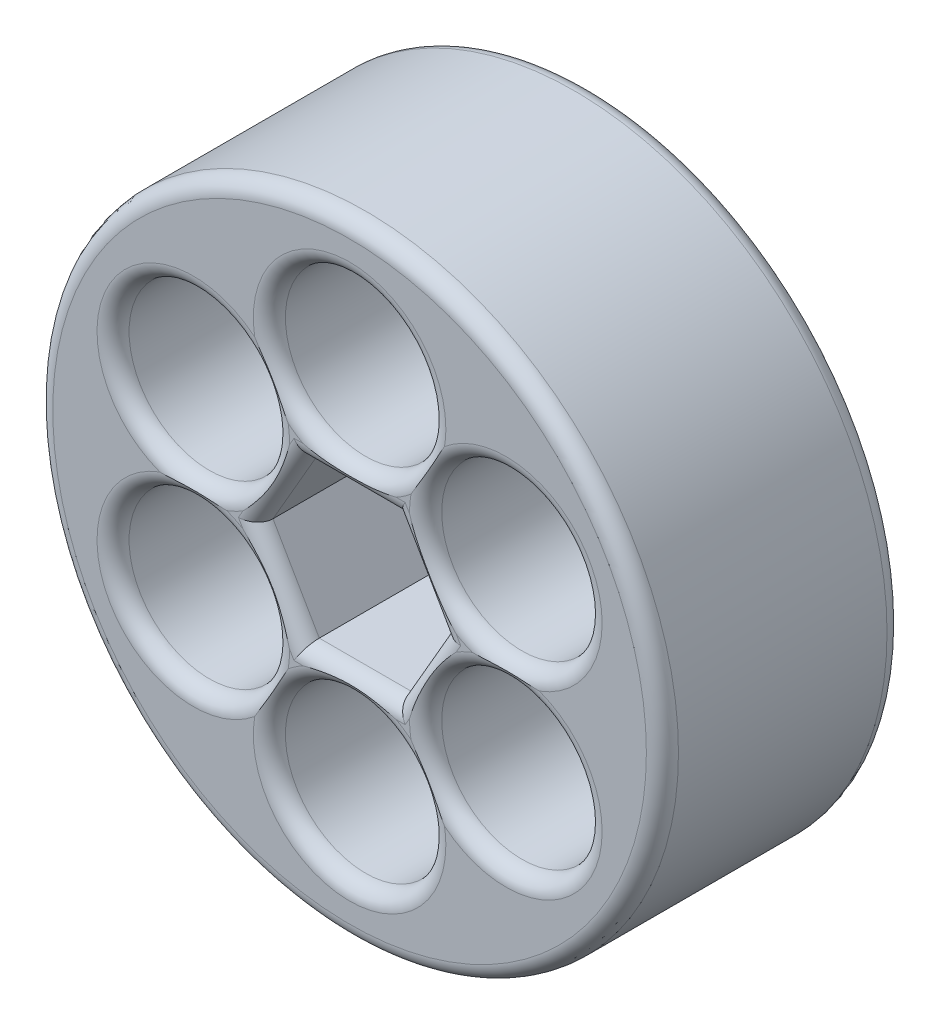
ISO-10303-21;
HEADER;
FILE_DESCRIPTION(('STEP AP214'),'2;1');
FILE_NAME('part.step','',(''),(''),'','','');
FILE_SCHEMA(('AUTOMOTIVE_DESIGN { 1 0 10303 214 1 1 1 1 }'));
ENDSEC;
DATA;
#1=APPLICATION_CONTEXT('core data for automotive mechanical design processes');
#2=APPLICATION_PROTOCOL_DEFINITION('international standard','automotive_design',2000,#1);
#3=PRODUCT_CONTEXT('',#1,'mechanical');
#4=PRODUCT('Part','Part','',(#3));
#5=PRODUCT_RELATED_PRODUCT_CATEGORY('part','',(#4));
#6=PRODUCT_DEFINITION_FORMATION('','',#4);
#7=PRODUCT_DEFINITION_CONTEXT('part definition',#1,'design');
#8=PRODUCT_DEFINITION('design','',#6,#7);
#9=PRODUCT_DEFINITION_SHAPE('','',#8);
#10=(LENGTH_UNIT() NAMED_UNIT(*) SI_UNIT(.MILLI.,.METRE.));
#11=(NAMED_UNIT(*) PLANE_ANGLE_UNIT() SI_UNIT($,.RADIAN.));
#12=(NAMED_UNIT(*) SI_UNIT($,.STERADIAN.) SOLID_ANGLE_UNIT());
#13=UNCERTAINTY_MEASURE_WITH_UNIT(LENGTH_MEASURE(1.E-05),#10,'distance_accuracy_value','');
#14=(GEOMETRIC_REPRESENTATION_CONTEXT(3) GLOBAL_UNCERTAINTY_ASSIGNED_CONTEXT((#13)) GLOBAL_UNIT_ASSIGNED_CONTEXT((#10,
#11,#12)) REPRESENTATION_CONTEXT('',''));
#15=CARTESIAN_POINT('',(0.,0.,0.));
#16=DIRECTION('',(0.,0.,1.));
#17=DIRECTION('',(1.,0.,0.));
#18=AXIS2_PLACEMENT_3D('',#15,#16,#17);
#19=CARTESIAN_POINT('',(0.,0.,15.));
#20=DIRECTION('',(0.,0.,1.));
#21=DIRECTION('',(1.,0.,0.));
#22=AXIS2_PLACEMENT_3D('',#19,#20,#21);
#23=PLANE('',#22);
#24=CARTESIAN_POINT('',(0.,0.,15.));
#25=DIRECTION('',(0.,0.,1.));
#26=DIRECTION('',(1.,0.,0.));
#27=AXIS2_PLACEMENT_3D('',#24,#25,#26);
#28=CIRCLE('',#27,18.5);
#29=CARTESIAN_POINT('',(18.5,0.,15.));
#30=VERTEX_POINT('',#29);
#31=EDGE_CURVE('E562',#30,#30,#28,.T.);
#32=ORIENTED_EDGE('',*,*,#31,.T.);
#33=EDGE_LOOP('',(#32));
#34=FACE_BOUND('',#33,.T.);
#35=CARTESIAN_POINT('',(-9.74278579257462,5.62499999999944,15.));
#36=DIRECTION('',(0.,0.,1.));
#37=DIRECTION('',(1.,0.,0.));
#38=AXIS2_PLACEMENT_3D('',#35,#36,#37);
#39=CIRCLE('',#38,6.);
#40=CARTESIAN_POINT('',(-11.8306974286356,-6.76542155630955E-13,15.));
#41=VERTEX_POINT('',#40);
#42=CARTESIAN_POINT('',(-5.91534871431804,10.2456845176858,15.));
#43=VERTEX_POINT('',#42);
#44=EDGE_CURVE('E552',#41,#43,#39,.F.);
#45=ORIENTED_EDGE('',*,*,#44,.T.);
#46=CARTESIAN_POINT('',(0.,11.25,15.));
#47=DIRECTION('',(0.,0.,1.));
#48=DIRECTION('',(1.,0.,0.));
#49=AXIS2_PLACEMENT_3D('',#46,#47,#48);
#50=CIRCLE('',#49,6.);
#51=CARTESIAN_POINT('',(6.,11.25,15.));
#52=VERTEX_POINT('',#51);
#53=EDGE_CURVE('E558',#43,#52,#50,.F.);
#54=ORIENTED_EDGE('',*,*,#53,.T.);
#55=CARTESIAN_POINT('',(0.,11.25,15.));
#56=DIRECTION('',(0.,0.,1.));
#57=DIRECTION('',(1.,0.,0.));
#58=AXIS2_PLACEMENT_3D('',#55,#56,#57);
#59=CIRCLE('',#58,6.);
#60=CARTESIAN_POINT('',(5.91534871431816,10.2456845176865,15.));
#61=VERTEX_POINT('',#60);
#62=EDGE_CURVE('E555',#52,#61,#59,.F.);
#63=ORIENTED_EDGE('',*,*,#62,.T.);
#64=CARTESIAN_POINT('',(9.74278579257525,5.62500000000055,15.));
#65=DIRECTION('',(0.,0.,1.));
#66=DIRECTION('',(1.,0.,0.));
#67=AXIS2_PLACEMENT_3D('',#64,#65,#66);
#68=CIRCLE('',#67,6.);
#69=CARTESIAN_POINT('',(15.7427857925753,5.62500000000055,15.));
#70=VERTEX_POINT('',#69);
#71=EDGE_CURVE('E549',#61,#70,#68,.F.);
#72=ORIENTED_EDGE('',*,*,#71,.T.);
#73=CARTESIAN_POINT('',(9.74278579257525,5.62500000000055,15.));
#74=DIRECTION('',(0.,0.,1.));
#75=DIRECTION('',(1.,0.,0.));
#76=AXIS2_PLACEMENT_3D('',#73,#74,#75);
#77=CIRCLE('',#76,6.);
#78=CARTESIAN_POINT('',(11.8306974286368,6.72205346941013E-13,15.));
#79=VERTEX_POINT('',#78);
#80=EDGE_CURVE('E546',#70,#79,#77,.F.);
#81=ORIENTED_EDGE('',*,*,#80,.T.);
#82=CARTESIAN_POINT('',(9.74278579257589,-5.62499999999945,15.));
#83=DIRECTION('',(0.,0.,1.));
#84=DIRECTION('',(1.,0.,0.));
#85=AXIS2_PLACEMENT_3D('',#82,#83,#84);
#86=CIRCLE('',#85,6.);
#87=CARTESIAN_POINT('',(15.7427857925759,-5.62499999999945,15.));
#88=VERTEX_POINT('',#87);
#89=EDGE_CURVE('E543',#79,#88,#86,.F.);
#90=ORIENTED_EDGE('',*,*,#89,.T.);
#91=CARTESIAN_POINT('',(9.74278579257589,-5.62499999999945,15.));
#92=DIRECTION('',(0.,0.,1.));
#93=DIRECTION('',(1.,0.,0.));
#94=AXIS2_PLACEMENT_3D('',#91,#92,#93);
#95=CIRCLE('',#94,6.);
#96=CARTESIAN_POINT('',(5.91534871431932,-10.2456845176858,15.));
#97=VERTEX_POINT('',#96);
#98=EDGE_CURVE('E540',#88,#97,#95,.F.);
#99=ORIENTED_EDGE('',*,*,#98,.T.);
#100=CARTESIAN_POINT('',(1.27484374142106E-12,-11.25,15.));
#101=DIRECTION('',(0.,0.,1.));
#102=DIRECTION('',(1.,0.,0.));
#103=AXIS2_PLACEMENT_3D('',#100,#101,#102);
#104=CIRCLE('',#103,6.);
#105=CARTESIAN_POINT('',(6.00000000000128,-11.25,15.));
#106=VERTEX_POINT('',#105);
#107=EDGE_CURVE('E534',#97,#106,#104,.F.);
#108=ORIENTED_EDGE('',*,*,#107,.T.);
#109=CARTESIAN_POINT('',(1.27484374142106E-12,-11.25,15.));
#110=DIRECTION('',(0.,0.,1.));
#111=DIRECTION('',(1.,0.,0.));
#112=AXIS2_PLACEMENT_3D('',#109,#110,#111);
#113=CIRCLE('',#112,6.);
#114=CARTESIAN_POINT('',(-5.91534871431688,-10.2456845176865,15.));
#115=VERTEX_POINT('',#114);
#116=EDGE_CURVE('E531',#106,#115,#113,.F.);
#117=ORIENTED_EDGE('',*,*,#116,.T.);
#118=CARTESIAN_POINT('',(-9.74278579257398,-5.62500000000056,15.));
#119=DIRECTION('',(0.,0.,1.));
#120=DIRECTION('',(1.,0.,0.));
#121=AXIS2_PLACEMENT_3D('',#118,#119,#120);
#122=CIRCLE('',#121,6.);
#123=EDGE_CURVE('E537',#115,#41,#122,.F.);
#124=ORIENTED_EDGE('',*,*,#123,.T.);
#125=EDGE_LOOP('',(#45,#54,#63,#72,#81,#90,#99,#108,#117,#124));
#126=FACE_BOUND('',#125,.T.);
#127=ADVANCED_FACE('F39',(#34,#126),#23,.T.);
#128=DIRECTION('',(-0.5,-0.866025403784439,0.));
#129=VECTOR('',#128,1.);
#130=CARTESIAN_POINT('',(-3.75277674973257,5.5,15.));
#131=LINE('',#130,#129);
#132=CARTESIAN_POINT('',(-6.92820323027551,0.,15.));
#133=VERTEX_POINT('',#132);
#134=CARTESIAN_POINT('',(-6.64852117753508,0.484423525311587,15.));
#135=VERTEX_POINT('',#134);
#136=EDGE_CURVE('E521',#133,#135,#131,.F.);
#137=ORIENTED_EDGE('',*,*,#136,.T.);
#138=CARTESIAN_POINT('',(-9.74278579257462,5.62499999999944,15.));
#139=DIRECTION('',(0.,0.,1.));
#140=DIRECTION('',(1.,0.,0.));
#141=AXIS2_PLACEMENT_3D('',#138,#139,#140);
#142=CIRCLE('',#141,6.);
#143=CARTESIAN_POINT('',(-7.65487415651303,-4.38017677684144E-13,15.));
#144=VERTEX_POINT('',#143);
#145=EDGE_CURVE('E527',#135,#144,#142,.F.);
#146=ORIENTED_EDGE('',*,*,#145,.T.);
#147=CARTESIAN_POINT('',(-9.74278579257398,-5.62500000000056,15.));
#148=DIRECTION('',(0.,0.,1.));
#149=DIRECTION('',(1.,0.,0.));
#150=AXIS2_PLACEMENT_3D('',#147,#148,#149);
#151=CIRCLE('',#150,6.);
#152=CARTESIAN_POINT('',(-6.64852117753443,-0.484423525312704,15.));
#153=VERTEX_POINT('',#152);
#154=EDGE_CURVE('E524',#144,#153,#151,.F.);
#155=ORIENTED_EDGE('',*,*,#154,.T.);
#156=DIRECTION('',(0.5,-0.866025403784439,0.));
#157=VECTOR('',#156,1.);
#158=CARTESIAN_POINT('',(-6.6395280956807,-0.500000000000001,15.));
#159=LINE('',#158,#157);
#160=EDGE_CURVE('E518',#153,#133,#159,.F.);
#161=ORIENTED_EDGE('',*,*,#160,.T.);
#162=EDGE_LOOP('',(#137,#146,#155,#161));
#163=FACE_BOUND('',#162,.T.);
#164=ADVANCED_FACE('F862',(#163),#23,.T.);
#165=DIRECTION('',(0.5,-0.866025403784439,0.));
#166=VECTOR('',#165,1.);
#167=CARTESIAN_POINT('',(-6.6395280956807,-0.500000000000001,15.));
#168=LINE('',#167,#166);
#169=CARTESIAN_POINT('',(-3.46410161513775,-6.,15.));
#170=VERTEX_POINT('',#169);
#171=CARTESIAN_POINT('',(-3.74378366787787,-5.51557647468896,15.));
#172=VERTEX_POINT('',#171);
#173=EDGE_CURVE('E505',#170,#172,#168,.F.);
#174=ORIENTED_EDGE('',*,*,#173,.T.);
#175=CARTESIAN_POINT('',(-9.74278579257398,-5.62500000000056,15.));
#176=DIRECTION('',(0.,0.,1.));
#177=DIRECTION('',(1.,0.,0.));
#178=AXIS2_PLACEMENT_3D('',#175,#176,#177);
#179=CIRCLE('',#178,6.);
#180=CARTESIAN_POINT('',(-3.74278579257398,-5.62500000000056,15.));
#181=VERTEX_POINT('',#180);
#182=EDGE_CURVE('E514',#172,#181,#179,.F.);
#183=ORIENTED_EDGE('',*,*,#182,.T.);
#184=CARTESIAN_POINT('',(-9.74278579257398,-5.62500000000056,15.));
#185=DIRECTION('',(0.,0.,1.));
#186=DIRECTION('',(1.,0.,0.));
#187=AXIS2_PLACEMENT_3D('',#184,#185,#186);
#188=CIRCLE('',#187,6.);
#189=CARTESIAN_POINT('',(-3.82743707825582,-6.62931548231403,15.));
#190=VERTEX_POINT('',#189);
#191=EDGE_CURVE('E511',#181,#190,#188,.F.);
#192=ORIENTED_EDGE('',*,*,#191,.T.);
#193=CARTESIAN_POINT('',(1.27484374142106E-12,-11.25,15.));
#194=DIRECTION('',(0.,0.,1.));
#195=DIRECTION('',(1.,0.,0.));
#196=AXIS2_PLACEMENT_3D('',#193,#194,#195);
#197=CIRCLE('',#196,6.);
#198=CARTESIAN_POINT('',(-2.90473750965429,-6.,15.));
#199=VERTEX_POINT('',#198);
#200=EDGE_CURVE('E508',#190,#199,#197,.F.);
#201=ORIENTED_EDGE('',*,*,#200,.T.);
#202=DIRECTION('',(1.,0.,0.));
#203=VECTOR('',#202,1.);
#204=CARTESIAN_POINT('',(-2.88675134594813,-6.,15.));
#205=LINE('',#204,#203);
#206=EDGE_CURVE('E502',#199,#170,#205,.F.);
#207=ORIENTED_EDGE('',*,*,#206,.T.);
#208=EDGE_LOOP('',(#174,#183,#192,#201,#207));
#209=FACE_BOUND('',#208,.T.);
#210=ADVANCED_FACE('F869',(#209),#23,.T.);
#211=CARTESIAN_POINT('',(1.27484374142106E-12,-11.25,15.));
#212=DIRECTION('',(0.,0.,1.));
#213=DIRECTION('',(1.,0.,0.));
#214=AXIS2_PLACEMENT_3D('',#211,#212,#213);
#215=CIRCLE('',#214,6.);
#216=CARTESIAN_POINT('',(2.90473750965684,-6.,15.));
#217=VERTEX_POINT('',#216);
#218=CARTESIAN_POINT('',(3.82743707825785,-6.6293154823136,15.));
#219=VERTEX_POINT('',#218);
#220=EDGE_CURVE('E495',#217,#219,#215,.F.);
#221=ORIENTED_EDGE('',*,*,#220,.T.);
#222=CARTESIAN_POINT('',(9.74278579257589,-5.62499999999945,15.));
#223=DIRECTION('',(0.,0.,1.));
#224=DIRECTION('',(1.,0.,0.));
#225=AXIS2_PLACEMENT_3D('',#222,#223,#224);
#226=CIRCLE('',#225,6.);
#227=CARTESIAN_POINT('',(3.74378366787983,-5.51557647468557,15.));
#228=VERTEX_POINT('',#227);
#229=EDGE_CURVE('E498',#219,#228,#226,.F.);
#230=ORIENTED_EDGE('',*,*,#229,.T.);
#231=DIRECTION('',(0.5,0.866025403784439,0.));
#232=VECTOR('',#231,1.);
#233=CARTESIAN_POINT('',(3.75277674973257,-5.5,15.));
#234=LINE('',#233,#232);
#235=CARTESIAN_POINT('',(3.46410161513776,-6.,15.));
#236=VERTEX_POINT('',#235);
#237=EDGE_CURVE('E489',#228,#236,#234,.F.);
#238=ORIENTED_EDGE('',*,*,#237,.T.);
#239=DIRECTION('',(1.,0.,0.));
#240=VECTOR('',#239,1.);
#241=CARTESIAN_POINT('',(-2.88675134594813,-6.,15.));
#242=LINE('',#241,#240);
#243=EDGE_CURVE('E492',#236,#217,#242,.F.);
#244=ORIENTED_EDGE('',*,*,#243,.T.);
#245=EDGE_LOOP('',(#221,#230,#238,#244));
#246=FACE_BOUND('',#245,.T.);
#247=ADVANCED_FACE('F897',(#246),#23,.T.);
#248=CARTESIAN_POINT('',(9.74278579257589,-5.62499999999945,15.));
#249=DIRECTION('',(0.,0.,1.));
#250=DIRECTION('',(1.,0.,0.));
#251=AXIS2_PLACEMENT_3D('',#248,#249,#250);
#252=CIRCLE('',#251,6.);
#253=CARTESIAN_POINT('',(6.64852117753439,-0.484423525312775,15.));
#254=VERTEX_POINT('',#253);
#255=CARTESIAN_POINT('',(7.65487415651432,4.33680868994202E-13,15.));
#256=VERTEX_POINT('',#255);
#257=EDGE_CURVE('E482',#254,#256,#252,.F.);
#258=ORIENTED_EDGE('',*,*,#257,.T.);
#259=CARTESIAN_POINT('',(9.74278579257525,5.62500000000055,15.));
#260=DIRECTION('',(0.,0.,1.));
#261=DIRECTION('',(1.,0.,0.));
#262=AXIS2_PLACEMENT_3D('',#259,#260,#261);
#263=CIRCLE('',#262,6.);
#264=CARTESIAN_POINT('',(6.64852117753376,0.484423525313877,15.));
#265=VERTEX_POINT('',#264);
#266=EDGE_CURVE('E485',#256,#265,#263,.F.);
#267=ORIENTED_EDGE('',*,*,#266,.T.);
#268=DIRECTION('',(-0.5,0.866025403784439,0.));
#269=VECTOR('',#268,1.);
#270=CARTESIAN_POINT('',(6.6395280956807,0.500000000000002,15.));
#271=LINE('',#270,#269);
#272=CARTESIAN_POINT('',(6.92820323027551,0.,15.));
#273=VERTEX_POINT('',#272);
#274=EDGE_CURVE('E476',#265,#273,#271,.F.);
#275=ORIENTED_EDGE('',*,*,#274,.T.);
#276=DIRECTION('',(0.5,0.866025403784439,0.));
#277=VECTOR('',#276,1.);
#278=CARTESIAN_POINT('',(3.75277674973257,-5.5,15.));
#279=LINE('',#278,#277);
#280=EDGE_CURVE('E479',#273,#254,#279,.F.);
#281=ORIENTED_EDGE('',*,*,#280,.T.);
#282=EDGE_LOOP('',(#258,#267,#275,#281));
#283=FACE_BOUND('',#282,.T.);
#284=ADVANCED_FACE('F890',(#283),#23,.T.);
#285=DIRECTION('',(-1.,0.,0.));
#286=VECTOR('',#285,1.);
#287=CARTESIAN_POINT('',(2.88675134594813,6.,15.));
#288=LINE('',#287,#286);
#289=CARTESIAN_POINT('',(-3.46410161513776,6.,15.));
#290=VERTEX_POINT('',#289);
#291=CARTESIAN_POINT('',(-2.90473750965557,6.,15.));
#292=VERTEX_POINT('',#291);
#293=EDGE_CURVE('E460',#290,#292,#288,.F.);
#294=ORIENTED_EDGE('',*,*,#293,.T.);
#295=CARTESIAN_POINT('',(0.,11.25,15.));
#296=DIRECTION('',(0.,0.,1.));
#297=DIRECTION('',(1.,0.,0.));
#298=AXIS2_PLACEMENT_3D('',#295,#296,#297);
#299=CIRCLE('',#298,6.);
#300=CARTESIAN_POINT('',(-3.82743707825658,6.62931548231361,15.));
#301=VERTEX_POINT('',#300);
#302=EDGE_CURVE('E472',#292,#301,#299,.F.);
#303=ORIENTED_EDGE('',*,*,#302,.T.);
#304=CARTESIAN_POINT('',(-9.74278579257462,5.62499999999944,15.));
#305=DIRECTION('',(0.,0.,1.));
#306=DIRECTION('',(1.,0.,0.));
#307=AXIS2_PLACEMENT_3D('',#304,#305,#306);
#308=CIRCLE('',#307,6.);
#309=CARTESIAN_POINT('',(-3.74278579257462,5.62499999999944,15.));
#310=VERTEX_POINT('',#309);
#311=EDGE_CURVE('E469',#301,#310,#308,.F.);
#312=ORIENTED_EDGE('',*,*,#311,.T.);
#313=CARTESIAN_POINT('',(-9.74278579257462,5.62499999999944,15.));
#314=DIRECTION('',(0.,0.,1.));
#315=DIRECTION('',(1.,0.,0.));
#316=AXIS2_PLACEMENT_3D('',#313,#314,#315);
#317=CIRCLE('',#316,6.);
#318=CARTESIAN_POINT('',(-3.74378366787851,5.51557647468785,15.));
#319=VERTEX_POINT('',#318);
#320=EDGE_CURVE('E466',#310,#319,#317,.F.);
#321=ORIENTED_EDGE('',*,*,#320,.T.);
#322=DIRECTION('',(-0.5,-0.866025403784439,0.));
#323=VECTOR('',#322,1.);
#324=CARTESIAN_POINT('',(-3.75277674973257,5.5,15.));
#325=LINE('',#324,#323);
#326=EDGE_CURVE('E463',#319,#290,#325,.F.);
#327=ORIENTED_EDGE('',*,*,#326,.T.);
#328=EDGE_LOOP('',(#294,#303,#312,#321,#327));
#329=FACE_BOUND('',#328,.T.);
#330=ADVANCED_FACE('F878',(#329),#23,.T.);
#331=CARTESIAN_POINT('',(0.,0.,0.));
#332=DIRECTION('',(0.,0.,1.));
#333=DIRECTION('',(1.,0.,0.));
#334=AXIS2_PLACEMENT_3D('',#331,#332,#333);
#335=PLANE('',#334);
#336=CARTESIAN_POINT('',(0.,0.,0.));
#337=DIRECTION('',(0.,0.,1.));
#338=DIRECTION('',(1.,0.,0.));
#339=AXIS2_PLACEMENT_3D('',#336,#337,#338);
#340=CIRCLE('',#339,18.5);
#341=CARTESIAN_POINT('',(18.5,0.,0.));
#342=VERTEX_POINT('',#341);
#343=EDGE_CURVE('E391',#342,#342,#340,.F.);
#344=ORIENTED_EDGE('',*,*,#343,.T.);
#345=EDGE_LOOP('',(#344));
#346=FACE_BOUND('',#345,.T.);
#347=CARTESIAN_POINT('',(9.74278579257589,-5.62499999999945,0.));
#348=DIRECTION('',(0.,0.,1.));
#349=DIRECTION('',(1.,0.,0.));
#350=AXIS2_PLACEMENT_3D('',#347,#348,#349);
#351=CIRCLE('',#350,6.);
#352=CARTESIAN_POINT('',(15.7427857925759,-5.62499999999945,0.));
#353=VERTEX_POINT('',#352);
#354=CARTESIAN_POINT('',(11.8306974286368,6.72205346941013E-13,0.));
#355=VERTEX_POINT('',#354);
#356=EDGE_CURVE('E378',#353,#355,#351,.T.);
#357=ORIENTED_EDGE('',*,*,#356,.T.);
#358=CARTESIAN_POINT('',(9.74278579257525,5.62500000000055,0.));
#359=DIRECTION('',(0.,0.,1.));
#360=DIRECTION('',(1.,0.,0.));
#361=AXIS2_PLACEMENT_3D('',#358,#359,#360);
#362=CIRCLE('',#361,6.);
#363=CARTESIAN_POINT('',(15.7427857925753,5.62500000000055,0.));
#364=VERTEX_POINT('',#363);
#365=EDGE_CURVE('E384',#355,#364,#362,.T.);
#366=ORIENTED_EDGE('',*,*,#365,.T.);
#367=CARTESIAN_POINT('',(9.74278579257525,5.62500000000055,0.));
#368=DIRECTION('',(0.,0.,1.));
#369=DIRECTION('',(1.,0.,0.));
#370=AXIS2_PLACEMENT_3D('',#367,#368,#369);
#371=CIRCLE('',#370,6.);
#372=CARTESIAN_POINT('',(5.91534871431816,10.2456845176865,0.));
#373=VERTEX_POINT('',#372);
#374=EDGE_CURVE('E381',#364,#373,#371,.T.);
#375=ORIENTED_EDGE('',*,*,#374,.T.);
#376=CARTESIAN_POINT('',(0.,11.25,0.));
#377=DIRECTION('',(0.,0.,1.));
#378=DIRECTION('',(1.,0.,0.));
#379=AXIS2_PLACEMENT_3D('',#376,#377,#378);
#380=CIRCLE('',#379,6.);
#381=CARTESIAN_POINT('',(6.,11.25,0.));
#382=VERTEX_POINT('',#381);
#383=EDGE_CURVE('E374',#373,#382,#380,.T.);
#384=ORIENTED_EDGE('',*,*,#383,.T.);
#385=CARTESIAN_POINT('',(0.,11.25,0.));
#386=DIRECTION('',(0.,0.,1.));
#387=DIRECTION('',(1.,0.,0.));
#388=AXIS2_PLACEMENT_3D('',#385,#386,#387);
#389=CIRCLE('',#388,6.);
#390=CARTESIAN_POINT('',(-5.91534871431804,10.2456845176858,0.));
#391=VERTEX_POINT('',#390);
#392=EDGE_CURVE('E371',#382,#391,#389,.T.);
#393=ORIENTED_EDGE('',*,*,#392,.T.);
#394=CARTESIAN_POINT('',(-9.74278579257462,5.62499999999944,0.));
#395=DIRECTION('',(0.,0.,1.));
#396=DIRECTION('',(1.,0.,0.));
#397=AXIS2_PLACEMENT_3D('',#394,#395,#396);
#398=CIRCLE('',#397,6.);
#399=CARTESIAN_POINT('',(-11.8306974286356,-6.76542155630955E-13,0.));
#400=VERTEX_POINT('',#399);
#401=EDGE_CURVE('E368',#391,#400,#398,.T.);
#402=ORIENTED_EDGE('',*,*,#401,.T.);
#403=CARTESIAN_POINT('',(-9.74278579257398,-5.62500000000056,0.));
#404=DIRECTION('',(0.,0.,1.));
#405=DIRECTION('',(1.,0.,0.));
#406=AXIS2_PLACEMENT_3D('',#403,#404,#405);
#407=CIRCLE('',#406,6.);
#408=CARTESIAN_POINT('',(-5.91534871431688,-10.2456845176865,0.));
#409=VERTEX_POINT('',#408);
#410=EDGE_CURVE('E362',#400,#409,#407,.T.);
#411=ORIENTED_EDGE('',*,*,#410,.T.);
#412=CARTESIAN_POINT('',(1.27484374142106E-12,-11.25,0.));
#413=DIRECTION('',(0.,0.,1.));
#414=DIRECTION('',(1.,0.,0.));
#415=AXIS2_PLACEMENT_3D('',#412,#413,#414);
#416=CIRCLE('',#415,6.);
#417=CARTESIAN_POINT('',(6.00000000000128,-11.25,0.));
#418=VERTEX_POINT('',#417);
#419=EDGE_CURVE('E359',#409,#418,#416,.T.);
#420=ORIENTED_EDGE('',*,*,#419,.T.);
#421=CARTESIAN_POINT('',(1.27484374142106E-12,-11.25,0.));
#422=DIRECTION('',(0.,0.,1.));
#423=DIRECTION('',(1.,0.,0.));
#424=AXIS2_PLACEMENT_3D('',#421,#422,#423);
#425=CIRCLE('',#424,6.);
#426=CARTESIAN_POINT('',(5.91534871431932,-10.2456845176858,0.));
#427=VERTEX_POINT('',#426);
#428=EDGE_CURVE('E356',#418,#427,#425,.T.);
#429=ORIENTED_EDGE('',*,*,#428,.T.);
#430=CARTESIAN_POINT('',(9.74278579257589,-5.62499999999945,0.));
#431=DIRECTION('',(0.,0.,1.));
#432=DIRECTION('',(1.,0.,0.));
#433=AXIS2_PLACEMENT_3D('',#430,#431,#432);
#434=CIRCLE('',#433,6.);
#435=EDGE_CURVE('E365',#427,#353,#434,.T.);
#436=ORIENTED_EDGE('',*,*,#435,.T.);
#437=EDGE_LOOP('',(#357,#366,#375,#384,#393,#402,#411,#420,#429,#436));
#438=FACE_BOUND('',#437,.T.);
#439=ADVANCED_FACE('F885',(#346,#438),#335,.F.);
#440=CARTESIAN_POINT('',(0.,0.,0.));
#441=DIRECTION('',(0.,0.,1.));
#442=DIRECTION('',(1.,0.,0.));
#443=AXIS2_PLACEMENT_3D('',#440,#441,#442);
#444=CYLINDRICAL_SURFACE('',#443,3.);
#445=CARTESIAN_POINT('',(0.,0.,1.));
#446=DIRECTION('',(0.,0.,1.));
#447=DIRECTION('',(1.,0.,0.));
#448=AXIS2_PLACEMENT_3D('',#445,#446,#447);
#449=CIRCLE('',#448,3.);
#450=CARTESIAN_POINT('',(3.,0.,1.));
#451=VERTEX_POINT('',#450);
#452=EDGE_CURVE('E395',#451,#451,#449,.F.);
#453=ORIENTED_EDGE('',*,*,#452,.T.);
#454=EDGE_LOOP('',(#453));
#455=FACE_BOUND('',#454,.T.);
#456=CARTESIAN_POINT('',(0.,0.,7.));
#457=DIRECTION('',(0.,0.,1.));
#458=DIRECTION('',(1.,0.,0.));
#459=AXIS2_PLACEMENT_3D('',#456,#457,#458);
#460=CIRCLE('',#459,3.);
#461=CARTESIAN_POINT('',(3.,0.,7.));
#462=VERTEX_POINT('',#461);
#463=EDGE_CURVE('E307',#462,#462,#460,.F.);
#464=ORIENTED_EDGE('',*,*,#463,.F.);
#465=EDGE_LOOP('',(#464));
#466=FACE_BOUND('',#465,.T.);
#467=ADVANCED_FACE('F886',(#455,#466),#444,.F.);
#468=CARTESIAN_POINT('',(0.,0.,15.));
#469=DIRECTION('',(0.,0.,-1.));
#470=DIRECTION('',(-1.,0.,0.));
#471=AXIS2_PLACEMENT_3D('',#468,#469,#470);
#472=CYLINDRICAL_SURFACE('',#471,19.5);
#473=CARTESIAN_POINT('',(0.,0.,1.));
#474=DIRECTION('',(0.,0.,1.));
#475=DIRECTION('',(1.,0.,0.));
#476=AXIS2_PLACEMENT_3D('',#473,#474,#475);
#477=CIRCLE('',#476,19.5);
#478=CARTESIAN_POINT('',(19.5,0.,1.));
#479=VERTEX_POINT('',#478);
#480=EDGE_CURVE('E327',#479,#479,#477,.T.);
#481=ORIENTED_EDGE('',*,*,#480,.T.);
#482=EDGE_LOOP('',(#481));
#483=FACE_BOUND('',#482,.T.);
#484=CARTESIAN_POINT('',(0.,0.,14.));
#485=DIRECTION('',(0.,0.,1.));
#486=DIRECTION('',(1.,0.,0.));
#487=AXIS2_PLACEMENT_3D('',#484,#485,#486);
#488=CIRCLE('',#487,19.5);
#489=CARTESIAN_POINT('',(19.5,0.,14.));
#490=VERTEX_POINT('',#489);
#491=EDGE_CURVE('E323',#490,#490,#488,.F.);
#492=ORIENTED_EDGE('',*,*,#491,.T.);
#493=EDGE_LOOP('',(#492));
#494=FACE_BOUND('',#493,.T.);
#495=ADVANCED_FACE('F876',(#483,#494),#472,.T.);
#496=CARTESIAN_POINT('',(9.74278579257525,5.62500000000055,15.));
#497=DIRECTION('',(0.,0.,1.));
#498=DIRECTION('',(1.,0.,0.));
#499=AXIS2_PLACEMENT_3D('',#496,#497,#498);
#500=CIRCLE('',#499,6.);
#501=CARTESIAN_POINT('',(3.74378366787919,5.51557647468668,15.));
#502=VERTEX_POINT('',#501);
#503=CARTESIAN_POINT('',(3.8274370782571,6.62931548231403,15.));
#504=VERTEX_POINT('',#503);
#505=EDGE_CURVE('E453',#502,#504,#500,.F.);
#506=ORIENTED_EDGE('',*,*,#505,.T.);
#507=CARTESIAN_POINT('',(0.,11.25,15.));
#508=DIRECTION('',(0.,0.,1.));
#509=DIRECTION('',(1.,0.,0.));
#510=AXIS2_PLACEMENT_3D('',#507,#508,#509);
#511=CIRCLE('',#510,6.);
#512=CARTESIAN_POINT('',(2.90473750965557,6.,15.));
#513=VERTEX_POINT('',#512);
#514=EDGE_CURVE('E456',#504,#513,#511,.F.);
#515=ORIENTED_EDGE('',*,*,#514,.T.);
#516=DIRECTION('',(-1.,0.,0.));
#517=VECTOR('',#516,1.);
#518=CARTESIAN_POINT('',(2.88675134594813,6.,15.));
#519=LINE('',#518,#517);
#520=CARTESIAN_POINT('',(3.46410161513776,6.,15.));
#521=VERTEX_POINT('',#520);
#522=EDGE_CURVE('E447',#513,#521,#519,.F.);
#523=ORIENTED_EDGE('',*,*,#522,.T.);
#524=DIRECTION('',(-0.5,0.866025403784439,0.));
#525=VECTOR('',#524,1.);
#526=CARTESIAN_POINT('',(6.6395280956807,0.500000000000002,15.));
#527=LINE('',#526,#525);
#528=EDGE_CURVE('E450',#521,#502,#527,.F.);
#529=ORIENTED_EDGE('',*,*,#528,.T.);
#530=EDGE_LOOP('',(#506,#515,#523,#529));
#531=FACE_BOUND('',#530,.T.);
#532=ADVANCED_FACE('F865',(#531),#23,.T.);
#533=CARTESIAN_POINT('',(0.,0.,0.));
#534=DIRECTION('',(0.,0.,1.));
#535=DIRECTION('',(1.,0.,0.));
#536=AXIS2_PLACEMENT_3D('',#533,#534,#535);
#537=CIRCLE('',#536,4.);
#538=CARTESIAN_POINT('',(4.,0.,0.));
#539=VERTEX_POINT('',#538);
#540=EDGE_CURVE('E387',#539,#539,#537,.T.);
#541=ORIENTED_EDGE('',*,*,#540,.T.);
#542=EDGE_LOOP('',(#541));
#543=FACE_BOUND('',#542,.T.);
#544=CARTESIAN_POINT('',(-9.74278579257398,-5.62500000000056,0.));
#545=DIRECTION('',(0.,0.,1.));
#546=DIRECTION('',(1.,0.,0.));
#547=AXIS2_PLACEMENT_3D('',#544,#545,#546);
#548=CIRCLE('',#547,6.);
#549=CARTESIAN_POINT('',(-3.74278579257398,-5.62500000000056,0.));
#550=VERTEX_POINT('',#549);
#551=CARTESIAN_POINT('',(-7.65487415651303,-4.38017677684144E-13,0.));
#552=VERTEX_POINT('',#551);
#553=EDGE_CURVE('E347',#550,#552,#548,.T.);
#554=ORIENTED_EDGE('',*,*,#553,.T.);
#555=CARTESIAN_POINT('',(-9.74278579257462,5.62499999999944,0.));
#556=DIRECTION('',(0.,0.,1.));
#557=DIRECTION('',(1.,0.,0.));
#558=AXIS2_PLACEMENT_3D('',#555,#556,#557);
#559=CIRCLE('',#558,6.);
#560=CARTESIAN_POINT('',(-3.74278579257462,5.62499999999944,0.));
#561=VERTEX_POINT('',#560);
#562=EDGE_CURVE('E353',#552,#561,#559,.T.);
#563=ORIENTED_EDGE('',*,*,#562,.T.);
#564=CARTESIAN_POINT('',(-9.74278579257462,5.62499999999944,0.));
#565=DIRECTION('',(0.,0.,1.));
#566=DIRECTION('',(1.,0.,0.));
#567=AXIS2_PLACEMENT_3D('',#564,#565,#566);
#568=CIRCLE('',#567,6.);
#569=CARTESIAN_POINT('',(-3.82743707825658,6.62931548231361,0.));
#570=VERTEX_POINT('',#569);
#571=EDGE_CURVE('E350',#561,#570,#568,.T.);
#572=ORIENTED_EDGE('',*,*,#571,.T.);
#573=CARTESIAN_POINT('',(0.,11.25,0.));
#574=DIRECTION('',(0.,0.,1.));
#575=DIRECTION('',(1.,0.,0.));
#576=AXIS2_PLACEMENT_3D('',#573,#574,#575);
#577=CIRCLE('',#576,6.);
#578=CARTESIAN_POINT('',(3.8274370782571,6.62931548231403,0.));
#579=VERTEX_POINT('',#578);
#580=EDGE_CURVE('E343',#570,#579,#577,.T.);
#581=ORIENTED_EDGE('',*,*,#580,.T.);
#582=CARTESIAN_POINT('',(9.74278579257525,5.62500000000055,0.));
#583=DIRECTION('',(0.,0.,1.));
#584=DIRECTION('',(1.,0.,0.));
#585=AXIS2_PLACEMENT_3D('',#582,#583,#584);
#586=CIRCLE('',#585,6.);
#587=CARTESIAN_POINT('',(7.65487415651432,4.33680868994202E-13,0.));
#588=VERTEX_POINT('',#587);
#589=EDGE_CURVE('E340',#579,#588,#586,.T.);
#590=ORIENTED_EDGE('',*,*,#589,.T.);
#591=CARTESIAN_POINT('',(9.74278579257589,-5.62499999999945,0.));
#592=DIRECTION('',(0.,0.,1.));
#593=DIRECTION('',(1.,0.,0.));
#594=AXIS2_PLACEMENT_3D('',#591,#592,#593);
#595=CIRCLE('',#594,6.);
#596=CARTESIAN_POINT('',(3.82743707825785,-6.6293154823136,0.));
#597=VERTEX_POINT('',#596);
#598=EDGE_CURVE('E337',#588,#597,#595,.T.);
#599=ORIENTED_EDGE('',*,*,#598,.T.);
#600=CARTESIAN_POINT('',(1.27484374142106E-12,-11.25,0.));
#601=DIRECTION('',(0.,0.,1.));
#602=DIRECTION('',(1.,0.,0.));
#603=AXIS2_PLACEMENT_3D('',#600,#601,#602);
#604=CIRCLE('',#603,6.);
#605=CARTESIAN_POINT('',(-3.82743707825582,-6.62931548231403,0.));
#606=VERTEX_POINT('',#605);
#607=EDGE_CURVE('E331',#597,#606,#604,.T.);
#608=ORIENTED_EDGE('',*,*,#607,.T.);
#609=CARTESIAN_POINT('',(-9.74278579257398,-5.62500000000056,0.));
#610=DIRECTION('',(0.,0.,1.));
#611=DIRECTION('',(1.,0.,0.));
#612=AXIS2_PLACEMENT_3D('',#609,#610,#611);
#613=CIRCLE('',#612,6.);
#614=EDGE_CURVE('E334',#606,#550,#613,.T.);
#615=ORIENTED_EDGE('',*,*,#614,.T.);
#616=EDGE_LOOP('',(#554,#563,#572,#581,#590,#599,#608,#615));
#617=FACE_BOUND('',#616,.T.);
#618=ADVANCED_FACE('F875',(#543,#617),#335,.F.);
#619=CARTESIAN_POINT('',(0.,11.25,0.));
#620=DIRECTION('',(0.,0.,1.));
#621=DIRECTION('',(1.,0.,0.));
#622=AXIS2_PLACEMENT_3D('',#619,#620,#621);
#623=CYLINDRICAL_SURFACE('',#622,5.);
#624=CARTESIAN_POINT('',(0.,11.25,1.));
#625=DIRECTION('',(0.,0.,1.));
#626=DIRECTION('',(1.,0.,0.));
#627=AXIS2_PLACEMENT_3D('',#624,#625,#626);
#628=CIRCLE('',#627,5.);
#629=CARTESIAN_POINT('',(5.,11.25,1.));
#630=VERTEX_POINT('',#629);
#631=EDGE_CURVE('E403',#630,#630,#628,.F.);
#632=ORIENTED_EDGE('',*,*,#631,.T.);
#633=EDGE_LOOP('',(#632));
#634=FACE_BOUND('',#633,.T.);
#635=CARTESIAN_POINT('',(0.,11.25,14.));
#636=DIRECTION('',(0.,0.,1.));
#637=DIRECTION('',(1.,0.,0.));
#638=AXIS2_PLACEMENT_3D('',#635,#636,#637);
#639=CIRCLE('',#638,5.);
#640=CARTESIAN_POINT('',(5.,11.25,14.));
#641=VERTEX_POINT('',#640);
#642=EDGE_CURVE('E399',#641,#641,#639,.T.);
#643=ORIENTED_EDGE('',*,*,#642,.T.);
#644=EDGE_LOOP('',(#643));
#645=FACE_BOUND('',#644,.T.);
#646=ADVANCED_FACE('F883',(#634,#645),#623,.F.);
#647=CARTESIAN_POINT('',(-9.74278579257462,5.62499999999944,0.));
#648=DIRECTION('',(0.,0.,1.));
#649=DIRECTION('',(1.,0.,0.));
#650=AXIS2_PLACEMENT_3D('',#647,#648,#649);
#651=CYLINDRICAL_SURFACE('',#650,5.);
#652=CARTESIAN_POINT('',(-9.74278579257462,5.62499999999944,1.));
#653=DIRECTION('',(0.,0.,1.));
#654=DIRECTION('',(1.,0.,0.));
#655=AXIS2_PLACEMENT_3D('',#652,#653,#654);
#656=CIRCLE('',#655,5.);
#657=CARTESIAN_POINT('',(-4.74278579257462,5.62499999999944,1.));
#658=VERTEX_POINT('',#657);
#659=EDGE_CURVE('E411',#658,#658,#656,.F.);
#660=ORIENTED_EDGE('',*,*,#659,.T.);
#661=EDGE_LOOP('',(#660));
#662=FACE_BOUND('',#661,.T.);
#663=CARTESIAN_POINT('',(-9.74278579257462,5.62499999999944,14.));
#664=DIRECTION('',(0.,0.,1.));
#665=DIRECTION('',(1.,0.,0.));
#666=AXIS2_PLACEMENT_3D('',#663,#664,#665);
#667=CIRCLE('',#666,5.);
#668=CARTESIAN_POINT('',(-4.74278579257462,5.62499999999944,14.));
#669=VERTEX_POINT('',#668);
#670=EDGE_CURVE('E407',#669,#669,#667,.T.);
#671=ORIENTED_EDGE('',*,*,#670,.T.);
#672=EDGE_LOOP('',(#671));
#673=FACE_BOUND('',#672,.T.);
#674=ADVANCED_FACE('F1225',(#662,#673),#651,.F.);
#675=CARTESIAN_POINT('',(9.74278579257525,5.62500000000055,0.));
#676=DIRECTION('',(0.,0.,1.));
#677=DIRECTION('',(1.,0.,0.));
#678=AXIS2_PLACEMENT_3D('',#675,#676,#677);
#679=CYLINDRICAL_SURFACE('',#678,5.);
#680=CARTESIAN_POINT('',(9.74278579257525,5.62500000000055,1.));
#681=DIRECTION('',(0.,0.,1.));
#682=DIRECTION('',(1.,0.,0.));
#683=AXIS2_PLACEMENT_3D('',#680,#681,#682);
#684=CIRCLE('',#683,5.);
#685=CARTESIAN_POINT('',(14.7427857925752,5.62500000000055,1.));
#686=VERTEX_POINT('',#685);
#687=EDGE_CURVE('E419',#686,#686,#684,.F.);
#688=ORIENTED_EDGE('',*,*,#687,.T.);
#689=EDGE_LOOP('',(#688));
#690=FACE_BOUND('',#689,.T.);
#691=CARTESIAN_POINT('',(9.74278579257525,5.62500000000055,14.));
#692=DIRECTION('',(0.,0.,1.));
#693=DIRECTION('',(1.,0.,0.));
#694=AXIS2_PLACEMENT_3D('',#691,#692,#693);
#695=CIRCLE('',#694,5.);
#696=CARTESIAN_POINT('',(14.7427857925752,5.62500000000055,14.));
#697=VERTEX_POINT('',#696);
#698=EDGE_CURVE('E415',#697,#697,#695,.T.);
#699=ORIENTED_EDGE('',*,*,#698,.T.);
#700=EDGE_LOOP('',(#699));
#701=FACE_BOUND('',#700,.T.);
#702=ADVANCED_FACE('F1221',(#690,#701),#679,.F.);
#703=CARTESIAN_POINT('',(9.74278579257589,-5.62499999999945,0.));
#704=DIRECTION('',(0.,0.,1.));
#705=DIRECTION('',(1.,0.,0.));
#706=AXIS2_PLACEMENT_3D('',#703,#704,#705);
#707=CYLINDRICAL_SURFACE('',#706,5.);
#708=CARTESIAN_POINT('',(9.74278579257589,-5.62499999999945,1.));
#709=DIRECTION('',(0.,0.,1.));
#710=DIRECTION('',(1.,0.,0.));
#711=AXIS2_PLACEMENT_3D('',#708,#709,#710);
#712=CIRCLE('',#711,5.);
#713=CARTESIAN_POINT('',(14.7427857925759,-5.62499999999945,1.));
#714=VERTEX_POINT('',#713);
#715=EDGE_CURVE('E427',#714,#714,#712,.F.);
#716=ORIENTED_EDGE('',*,*,#715,.T.);
#717=EDGE_LOOP('',(#716));
#718=FACE_BOUND('',#717,.T.);
#719=CARTESIAN_POINT('',(9.74278579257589,-5.62499999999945,14.));
#720=DIRECTION('',(0.,0.,1.));
#721=DIRECTION('',(1.,0.,0.));
#722=AXIS2_PLACEMENT_3D('',#719,#720,#721);
#723=CIRCLE('',#722,5.);
#724=CARTESIAN_POINT('',(14.7427857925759,-5.62499999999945,14.));
#725=VERTEX_POINT('',#724);
#726=EDGE_CURVE('E423',#725,#725,#723,.T.);
#727=ORIENTED_EDGE('',*,*,#726,.T.);
#728=EDGE_LOOP('',(#727));
#729=FACE_BOUND('',#728,.T.);
#730=ADVANCED_FACE('F1213',(#718,#729),#707,.F.);
#731=CARTESIAN_POINT('',(-9.74278579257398,-5.62500000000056,0.));
#732=DIRECTION('',(0.,0.,1.));
#733=DIRECTION('',(1.,0.,0.));
#734=AXIS2_PLACEMENT_3D('',#731,#732,#733);
#735=CYLINDRICAL_SURFACE('',#734,5.);
#736=CARTESIAN_POINT('',(-9.74278579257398,-5.62500000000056,1.));
#737=DIRECTION('',(0.,0.,1.));
#738=DIRECTION('',(1.,0.,0.));
#739=AXIS2_PLACEMENT_3D('',#736,#737,#738);
#740=CIRCLE('',#739,5.);
#741=CARTESIAN_POINT('',(-4.74278579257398,-5.62500000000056,1.));
#742=VERTEX_POINT('',#741);
#743=EDGE_CURVE('E435',#742,#742,#740,.F.);
#744=ORIENTED_EDGE('',*,*,#743,.T.);
#745=EDGE_LOOP('',(#744));
#746=FACE_BOUND('',#745,.T.);
#747=CARTESIAN_POINT('',(-9.74278579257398,-5.62500000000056,14.));
#748=DIRECTION('',(0.,0.,1.));
#749=DIRECTION('',(1.,0.,0.));
#750=AXIS2_PLACEMENT_3D('',#747,#748,#749);
#751=CIRCLE('',#750,5.);
#752=CARTESIAN_POINT('',(-4.74278579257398,-5.62500000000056,14.));
#753=VERTEX_POINT('',#752);
#754=EDGE_CURVE('E431',#753,#753,#751,.T.);
#755=ORIENTED_EDGE('',*,*,#754,.T.);
#756=EDGE_LOOP('',(#755));
#757=FACE_BOUND('',#756,.T.);
#758=ADVANCED_FACE('F1211',(#746,#757),#735,.F.);
#759=CARTESIAN_POINT('',(1.27484374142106E-12,-11.25,0.));
#760=DIRECTION('',(0.,0.,1.));
#761=DIRECTION('',(1.,0.,0.));
#762=AXIS2_PLACEMENT_3D('',#759,#760,#761);
#763=CYLINDRICAL_SURFACE('',#762,5.);
#764=CARTESIAN_POINT('',(1.27484374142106E-12,-11.25,1.));
#765=DIRECTION('',(0.,0.,1.));
#766=DIRECTION('',(1.,0.,0.));
#767=AXIS2_PLACEMENT_3D('',#764,#765,#766);
#768=CIRCLE('',#767,5.);
#769=CARTESIAN_POINT('',(5.00000000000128,-11.25,1.));
#770=VERTEX_POINT('',#769);
#771=EDGE_CURVE('E443',#770,#770,#768,.F.);
#772=ORIENTED_EDGE('',*,*,#771,.T.);
#773=EDGE_LOOP('',(#772));
#774=FACE_BOUND('',#773,.T.);
#775=CARTESIAN_POINT('',(1.27484374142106E-12,-11.25,14.));
#776=DIRECTION('',(0.,0.,1.));
#777=DIRECTION('',(1.,0.,0.));
#778=AXIS2_PLACEMENT_3D('',#775,#776,#777);
#779=CIRCLE('',#778,5.);
#780=CARTESIAN_POINT('',(5.00000000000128,-11.25,14.));
#781=VERTEX_POINT('',#780);
#782=EDGE_CURVE('E439',#781,#781,#779,.T.);
#783=ORIENTED_EDGE('',*,*,#782,.T.);
#784=EDGE_LOOP('',(#783));
#785=FACE_BOUND('',#784,.T.);
#786=ADVANCED_FACE('F986',(#774,#785),#763,.F.);
#787=CARTESIAN_POINT('',(0.,0.,7.));
#788=DIRECTION('',(0.,0.,1.));
#789=DIRECTION('',(1.,0.,0.));
#790=AXIS2_PLACEMENT_3D('',#787,#788,#789);
#791=PLANE('',#790);
#792=DIRECTION('',(-1.,0.,0.));
#793=VECTOR('',#792,1.);
#794=CARTESIAN_POINT('',(2.88675134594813,5.,7.));
#795=LINE('',#794,#793);
#796=CARTESIAN_POINT('',(2.88675134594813,5.,7.));
#797=VERTEX_POINT('',#796);
#798=CARTESIAN_POINT('',(-2.88675134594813,5.,7.));
#799=VERTEX_POINT('',#798);
#800=EDGE_CURVE('E261',#797,#799,#795,.T.);
#801=ORIENTED_EDGE('',*,*,#800,.T.);
#802=DIRECTION('',(-0.5,-0.866025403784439,0.));
#803=VECTOR('',#802,1.);
#804=CARTESIAN_POINT('',(-2.88675134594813,5.,7.));
#805=LINE('',#804,#803);
#806=CARTESIAN_POINT('',(-5.77350269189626,0.,7.));
#807=VERTEX_POINT('',#806);
#808=EDGE_CURVE('E272',#799,#807,#805,.T.);
#809=ORIENTED_EDGE('',*,*,#808,.T.);
#810=DIRECTION('',(0.5,-0.866025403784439,0.));
#811=VECTOR('',#810,1.);
#812=CARTESIAN_POINT('',(-5.77350269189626,0.,7.));
#813=LINE('',#812,#811);
#814=CARTESIAN_POINT('',(-2.88675134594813,-5.,7.));
#815=VERTEX_POINT('',#814);
#816=EDGE_CURVE('E279',#807,#815,#813,.T.);
#817=ORIENTED_EDGE('',*,*,#816,.T.);
#818=DIRECTION('',(1.,0.,0.));
#819=VECTOR('',#818,1.);
#820=CARTESIAN_POINT('',(-2.88675134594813,-5.,7.));
#821=LINE('',#820,#819);
#822=CARTESIAN_POINT('',(2.88675134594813,-5.,7.));
#823=VERTEX_POINT('',#822);
#824=EDGE_CURVE('E295',#815,#823,#821,.T.);
#825=ORIENTED_EDGE('',*,*,#824,.T.);
#826=DIRECTION('',(0.5,0.866025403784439,0.));
#827=VECTOR('',#826,1.);
#828=CARTESIAN_POINT('',(2.88675134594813,-5.,7.));
#829=LINE('',#828,#827);
#830=CARTESIAN_POINT('',(5.77350269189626,0.,7.));
#831=VERTEX_POINT('',#830);
#832=EDGE_CURVE('E299',#823,#831,#829,.T.);
#833=ORIENTED_EDGE('',*,*,#832,.T.);
#834=DIRECTION('',(-0.5,0.866025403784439,0.));
#835=VECTOR('',#834,1.);
#836=CARTESIAN_POINT('',(5.77350269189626,0.,7.));
#837=LINE('',#836,#835);
#838=EDGE_CURVE('E269',#831,#797,#837,.T.);
#839=ORIENTED_EDGE('',*,*,#838,.T.);
#840=EDGE_LOOP('',(#801,#809,#817,#825,#833,#839));
#841=FACE_BOUND('',#840,.T.);
#842=ORIENTED_EDGE('',*,*,#463,.T.);
#843=EDGE_LOOP('',(#842));
#844=FACE_BOUND('',#843,.T.);
#845=ADVANCED_FACE('F281',(#841,#844),#791,.T.);
#846=CARTESIAN_POINT('',(2.88675134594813,5.,7.));
#847=DIRECTION('',(0.,1.,0.));
#848=DIRECTION('',(-1.,0.,0.));
#849=AXIS2_PLACEMENT_3D('',#846,#847,#848);
#850=PLANE('',#849);
#851=DIRECTION('',(0.,0.,1.));
#852=VECTOR('',#851,1.);
#853=CARTESIAN_POINT('',(2.88675134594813,5.,7.));
#854=LINE('',#853,#852);
#855=CARTESIAN_POINT('',(2.88675134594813,5.,14.));
#856=VERTEX_POINT('',#855);
#857=EDGE_CURVE('E304',#797,#856,#854,.T.);
#858=ORIENTED_EDGE('',*,*,#857,.T.);
#859=DIRECTION('',(-1.,0.,0.));
#860=VECTOR('',#859,1.);
#861=CARTESIAN_POINT('',(-2.88675134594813,5.,14.));
#862=LINE('',#861,#860);
#863=CARTESIAN_POINT('',(-2.88675134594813,5.,14.));
#864=VERTEX_POINT('',#863);
#865=EDGE_CURVE('E11',#856,#864,#862,.T.);
#866=ORIENTED_EDGE('',*,*,#865,.T.);
#867=DIRECTION('',(0.,0.,1.));
#868=VECTOR('',#867,1.);
#869=CARTESIAN_POINT('',(-2.88675134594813,5.,7.));
#870=LINE('',#869,#868);
#871=EDGE_CURVE('E257',#799,#864,#870,.T.);
#872=ORIENTED_EDGE('',*,*,#871,.F.);
#873=ORIENTED_EDGE('',*,*,#800,.F.);
#874=EDGE_LOOP('',(#858,#866,#872,#873));
#875=FACE_BOUND('',#874,.T.);
#876=ADVANCED_FACE('F259',(#875),#850,.F.);
#877=CARTESIAN_POINT('',(5.77350269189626,0.,7.));
#878=DIRECTION('',(0.866025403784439,0.5,0.));
#879=DIRECTION('',(-0.5,0.866025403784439,0.));
#880=AXIS2_PLACEMENT_3D('',#877,#878,#879);
#881=PLANE('',#880);
#882=DIRECTION('',(0.,0.,1.));
#883=VECTOR('',#882,1.);
#884=CARTESIAN_POINT('',(5.77350269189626,0.,7.));
#885=LINE('',#884,#883);
#886=CARTESIAN_POINT('',(5.77350269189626,0.,14.));
#887=VERTEX_POINT('',#886);
#888=EDGE_CURVE('E308',#831,#887,#885,.T.);
#889=ORIENTED_EDGE('',*,*,#888,.T.);
#890=DIRECTION('',(-0.5,0.866025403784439,0.));
#891=VECTOR('',#890,1.);
#892=CARTESIAN_POINT('',(2.88675134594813,5.,14.));
#893=LINE('',#892,#891);
#894=EDGE_CURVE('E50',#887,#856,#893,.T.);
#895=ORIENTED_EDGE('',*,*,#894,.T.);
#896=ORIENTED_EDGE('',*,*,#857,.F.);
#897=ORIENTED_EDGE('',*,*,#838,.F.);
#898=EDGE_LOOP('',(#889,#895,#896,#897));
#899=FACE_BOUND('',#898,.T.);
#900=ADVANCED_FACE('F1001',(#899),#881,.F.);
#901=CARTESIAN_POINT('',(2.88675134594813,-5.,7.));
#902=DIRECTION('',(0.866025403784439,-0.5,0.));
#903=DIRECTION('',(0.5,0.866025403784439,0.));
#904=AXIS2_PLACEMENT_3D('',#901,#902,#903);
#905=PLANE('',#904);
#906=DIRECTION('',(0.,0.,1.));
#907=VECTOR('',#906,1.);
#908=CARTESIAN_POINT('',(2.88675134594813,-5.,7.));
#909=LINE('',#908,#907);
#910=CARTESIAN_POINT('',(2.88675134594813,-5.,14.));
#911=VERTEX_POINT('',#910);
#912=EDGE_CURVE('E311',#823,#911,#909,.T.);
#913=ORIENTED_EDGE('',*,*,#912,.T.);
#914=DIRECTION('',(0.5,0.866025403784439,0.));
#915=VECTOR('',#914,1.);
#916=CARTESIAN_POINT('',(5.77350269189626,0.,14.));
#917=LINE('',#916,#915);
#918=EDGE_CURVE('E65',#911,#887,#917,.T.);
#919=ORIENTED_EDGE('',*,*,#918,.T.);
#920=ORIENTED_EDGE('',*,*,#888,.F.);
#921=ORIENTED_EDGE('',*,*,#832,.F.);
#922=EDGE_LOOP('',(#913,#919,#920,#921));
#923=FACE_BOUND('',#922,.T.);
#924=ADVANCED_FACE('F849',(#923),#905,.F.);
#925=CARTESIAN_POINT('',(-2.88675134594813,-5.,7.));
#926=DIRECTION('',(0.,-1.,0.));
#927=DIRECTION('',(1.,0.,0.));
#928=AXIS2_PLACEMENT_3D('',#925,#926,#927);
#929=PLANE('',#928);
#930=DIRECTION('',(0.,0.,1.));
#931=VECTOR('',#930,1.);
#932=CARTESIAN_POINT('',(-2.88675134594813,-5.,7.));
#933=LINE('',#932,#931);
#934=CARTESIAN_POINT('',(-2.88675134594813,-5.,14.));
#935=VERTEX_POINT('',#934);
#936=EDGE_CURVE('E314',#815,#935,#933,.T.);
#937=ORIENTED_EDGE('',*,*,#936,.T.);
#938=DIRECTION('',(1.,0.,0.));
#939=VECTOR('',#938,1.);
#940=CARTESIAN_POINT('',(2.88675134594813,-5.,14.));
#941=LINE('',#940,#939);
#942=EDGE_CURVE('E572',#935,#911,#941,.T.);
#943=ORIENTED_EDGE('',*,*,#942,.T.);
#944=ORIENTED_EDGE('',*,*,#912,.F.);
#945=ORIENTED_EDGE('',*,*,#824,.F.);
#946=EDGE_LOOP('',(#937,#943,#944,#945));
#947=FACE_BOUND('',#946,.T.);
#948=ADVANCED_FACE('F846',(#947),#929,.F.);
#949=CARTESIAN_POINT('',(-5.77350269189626,0.,7.));
#950=DIRECTION('',(-0.866025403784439,-0.5,0.));
#951=DIRECTION('',(0.5,-0.866025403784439,0.));
#952=AXIS2_PLACEMENT_3D('',#949,#950,#951);
#953=PLANE('',#952);
#954=DIRECTION('',(0.,0.,1.));
#955=VECTOR('',#954,1.);
#956=CARTESIAN_POINT('',(-5.77350269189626,0.,7.));
#957=LINE('',#956,#955);
#958=CARTESIAN_POINT('',(-5.77350269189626,0.,14.));
#959=VERTEX_POINT('',#958);
#960=EDGE_CURVE('E268',#807,#959,#957,.T.);
#961=ORIENTED_EDGE('',*,*,#960,.T.);
#962=DIRECTION('',(0.5,-0.866025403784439,0.));
#963=VECTOR('',#962,1.);
#964=CARTESIAN_POINT('',(-2.88675134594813,-5.,14.));
#965=LINE('',#964,#963);
#966=EDGE_CURVE('E569',#959,#935,#965,.T.);
#967=ORIENTED_EDGE('',*,*,#966,.T.);
#968=ORIENTED_EDGE('',*,*,#936,.F.);
#969=ORIENTED_EDGE('',*,*,#816,.F.);
#970=EDGE_LOOP('',(#961,#967,#968,#969));
#971=FACE_BOUND('',#970,.T.);
#972=ADVANCED_FACE('F851',(#971),#953,.F.);
#973=CARTESIAN_POINT('',(-2.88675134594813,5.,7.));
#974=DIRECTION('',(-0.866025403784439,0.5,0.));
#975=DIRECTION('',(-0.5,-0.866025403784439,0.));
#976=AXIS2_PLACEMENT_3D('',#973,#974,#975);
#977=PLANE('',#976);
#978=ORIENTED_EDGE('',*,*,#871,.T.);
#979=DIRECTION('',(-0.5,-0.866025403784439,0.));
#980=VECTOR('',#979,1.);
#981=CARTESIAN_POINT('',(-5.77350269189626,0.,14.));
#982=LINE('',#981,#980);
#983=EDGE_CURVE('E566',#864,#959,#982,.T.);
#984=ORIENTED_EDGE('',*,*,#983,.T.);
#985=ORIENTED_EDGE('',*,*,#960,.F.);
#986=ORIENTED_EDGE('',*,*,#808,.F.);
#987=EDGE_LOOP('',(#978,#984,#985,#986));
#988=FACE_BOUND('',#987,.T.);
#989=ADVANCED_FACE('F273',(#988),#977,.F.);
#990=CARTESIAN_POINT('',(0.,0.,1.));
#991=DIRECTION('',(0.,0.,1.));
#992=DIRECTION('',(1.,0.,0.));
#993=AXIS2_PLACEMENT_3D('',#990,#991,#992);
#994=TOROIDAL_SURFACE('',#993,18.5,1.);
#995=ORIENTED_EDGE('',*,*,#343,.F.);
#996=EDGE_LOOP('',(#995));
#997=FACE_BOUND('',#996,.T.);
#998=ORIENTED_EDGE('',*,*,#480,.F.);
#999=EDGE_LOOP('',(#998));
#1000=FACE_BOUND('',#999,.T.);
#1001=ADVANCED_FACE('F858',(#997,#1000),#994,.T.);
#1002=CARTESIAN_POINT('',(0.,0.,1.));
#1003=DIRECTION('',(0.,0.,1.));
#1004=DIRECTION('',(1.,0.,0.));
#1005=AXIS2_PLACEMENT_3D('',#1002,#1003,#1004);
#1006=TOROIDAL_SURFACE('',#1005,4.,1.);
#1007=ORIENTED_EDGE('',*,*,#452,.F.);
#1008=EDGE_LOOP('',(#1007));
#1009=FACE_BOUND('',#1008,.T.);
#1010=ORIENTED_EDGE('',*,*,#540,.F.);
#1011=EDGE_LOOP('',(#1010));
#1012=FACE_BOUND('',#1011,.T.);
#1013=ADVANCED_FACE('F652',(#1009,#1012),#1006,.T.);
#1014=CARTESIAN_POINT('',(1.27484374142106E-12,-11.25,1.));
#1015=DIRECTION('',(0.,0.,1.));
#1016=DIRECTION('',(1.,0.,0.));
#1017=AXIS2_PLACEMENT_3D('',#1014,#1015,#1016);
#1018=TOROIDAL_SURFACE('',#1017,6.,1.);
#1019=ORIENTED_EDGE('',*,*,#771,.F.);
#1020=EDGE_LOOP('',(#1019));
#1021=FACE_BOUND('',#1020,.T.);
#1022=CARTESIAN_POINT('',(-3.82743707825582,-6.62931548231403,0.));
#1023=CARTESIAN_POINT('',(-3.82874204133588,-6.63157574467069,1.20712581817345E-08));
#1024=CARTESIAN_POINT('',(-3.83004700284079,-6.63383600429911,1.24896648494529E-06));
#1025=CARTESIAN_POINT('',(-3.91473579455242,-6.78052129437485,0.000160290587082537));
#1026=CARTESIAN_POINT('',(-3.99811233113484,-6.92493369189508,0.00527254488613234));
#1027=CARTESIAN_POINT('',(-4.16478493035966,-7.21361910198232,0.0196385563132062));
#1028=CARTESIAN_POINT('',(-4.248080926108,-7.35789199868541,0.0288945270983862));
#1029=CARTESIAN_POINT('',(-4.41467471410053,-7.6464409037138,0.046653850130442));
#1030=CARTESIAN_POINT('',(-4.49797249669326,-7.79071689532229,0.0551574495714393));
#1031=CARTESIAN_POINT('',(-4.62296444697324,-8.00720930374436,0.0646043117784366));
#1032=CARTESIAN_POINT('',(-4.66462555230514,-8.0793684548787,0.0672016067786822));
#1033=CARTESIAN_POINT('',(-4.7479630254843,-8.22371319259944,0.0710318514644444));
#1034=CARTESIAN_POINT('',(-4.78963939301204,-8.2958987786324,0.0722648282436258));
#1035=CARTESIAN_POINT('',(-4.87592366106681,-8.44534751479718,0.0732576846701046));
#1036=CARTESIAN_POINT('',(-4.92053190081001,-8.52261125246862,0.0729080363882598));
#1037=CARTESIAN_POINT('',(-5.0097370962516,-8.67711918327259,0.0705274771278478));
#1038=CARTESIAN_POINT('',(-5.05433405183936,-8.7543633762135,0.0684965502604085));
#1039=CARTESIAN_POINT('',(-5.14352817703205,-8.90885213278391,0.0630056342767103));
#1040=CARTESIAN_POINT('',(-5.188125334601,-8.9860966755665,0.0595448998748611));
#1041=CARTESIAN_POINT('',(-5.27729823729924,-9.14054867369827,0.0516362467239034));
#1042=CARTESIAN_POINT('',(-5.32187398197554,-9.21775612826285,0.0471883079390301));
#1043=CARTESIAN_POINT('',(-5.45561425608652,-9.44940107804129,0.0332046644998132));
#1044=CARTESIAN_POINT('',(-5.54475842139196,-9.60380330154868,0.0230319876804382));
#1045=CARTESIAN_POINT('',(-5.72312798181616,-9.91274844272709,0.00674497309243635));
#1046=CARTESIAN_POINT('',(-5.8123533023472,-10.0672912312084,0.000628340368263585));
#1047=CARTESIAN_POINT('',(-5.90487539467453,-10.2275441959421,2.38522545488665E-05));
#1048=CARTESIAN_POINT('',(-5.90815461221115,-10.2332239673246,9.89904927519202E-06));
#1049=CARTESIAN_POINT('',(-5.91273879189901,-10.241163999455,1.23256287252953E-06));
#1050=CARTESIAN_POINT('',(-5.91404375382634,-10.243424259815,-6.57927766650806E-09));
#1051=CARTESIAN_POINT('',(-5.91534871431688,-10.2456845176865,0.));
#1052=B_SPLINE_CURVE_WITH_KNOTS('',3,(#1022,#1023,#1024,#1025,#1026,#1027,#1028,#1029,#1030,
#1031,#1032,#1033,#1034,#1035,#1036,#1037,#1038,#1039,#1040,#1041,#1042,#1043,#1044,#1045,#1046,
#1047,#1048,#1049,#1050,#1051),.UNSPECIFIED.,.F.,.F.,(4,2,2,2,2,2,2,2,2,2,2,2,2,2,4),(0.,
0.00782976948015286,0.508133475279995,1.00870477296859,1.50911099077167,1.75918905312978,
2.00926214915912,2.27689650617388,2.54453339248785,2.81230996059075,3.0800919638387,
3.61585654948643,4.15131773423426,4.17099303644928,4.17882280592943),.UNSPECIFIED.);
#1053=EDGE_CURVE('E290',#606,#409,#1052,.T.);
#1054=ORIENTED_EDGE('',*,*,#1053,.F.);
#1055=ORIENTED_EDGE('',*,*,#607,.F.);
#1056=CARTESIAN_POINT('',(5.91534871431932,-10.2456845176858,0.));
#1057=CARTESIAN_POINT('',(5.91404375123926,-10.2434242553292,1.20712242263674E-08));
#1058=CARTESIAN_POINT('',(5.91273878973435,-10.2411639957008,1.24896646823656E-06));
#1059=CARTESIAN_POINT('',(5.82804999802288,-10.0944787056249,0.000160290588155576));
#1060=CARTESIAN_POINT('',(5.74467346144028,-9.95006630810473,0.00527254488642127));
#1061=CARTESIAN_POINT('',(5.5780008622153,-9.66138089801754,0.0196385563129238));
#1062=CARTESIAN_POINT('',(5.49470486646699,-9.51710800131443,0.0288945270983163));
#1063=CARTESIAN_POINT('',(5.32811107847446,-9.22855909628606,0.046653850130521));
#1064=CARTESIAN_POINT('',(5.24481329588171,-9.08428310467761,0.0551574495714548));
#1065=CARTESIAN_POINT('',(5.11982134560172,-8.86779069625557,0.0646043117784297));
#1066=CARTESIAN_POINT('',(5.07816024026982,-8.79563154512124,0.0672016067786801));
#1067=CARTESIAN_POINT('',(4.99482276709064,-8.65128680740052,0.0710318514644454));
#1068=CARTESIAN_POINT('',(4.95314639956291,-8.57910122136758,0.0722648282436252));
#1069=CARTESIAN_POINT('',(4.86686213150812,-8.42965248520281,0.0732576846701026));
#1070=CARTESIAN_POINT('',(4.82225389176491,-8.35238874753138,0.0729080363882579));
#1071=CARTESIAN_POINT('',(4.73304869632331,-8.19788081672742,0.0705274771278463));
#1072=CARTESIAN_POINT('',(4.68845174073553,-8.12063662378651,0.0684965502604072));
#1073=CARTESIAN_POINT('',(4.59925761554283,-7.96614786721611,0.0630056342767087));
#1074=CARTESIAN_POINT('',(4.55466045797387,-7.88890332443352,0.0595448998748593));
#1075=CARTESIAN_POINT('',(4.46548755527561,-7.73445132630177,0.0516362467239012));
#1076=CARTESIAN_POINT('',(4.4209118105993,-7.65724387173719,0.0471883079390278));
#1077=CARTESIAN_POINT('',(4.28717153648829,-7.42559892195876,0.0332046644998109));
#1078=CARTESIAN_POINT('',(4.19802737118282,-7.27119669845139,0.0230319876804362));
#1079=CARTESIAN_POINT('',(4.01965781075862,-6.962251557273,0.00674497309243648));
#1080=CARTESIAN_POINT('',(3.93043249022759,-6.80770876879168,0.000628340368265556));
#1081=CARTESIAN_POINT('',(3.83791039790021,-6.64745580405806,2.38522545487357E-05));
#1082=CARTESIAN_POINT('',(3.83463118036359,-6.64177603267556,9.89904927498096E-06));
#1083=CARTESIAN_POINT('',(3.83004700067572,-6.63383600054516,1.23256287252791E-06));
#1084=CARTESIAN_POINT('',(3.8287420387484,-6.63157574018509,-6.57927757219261E-09));
#1085=CARTESIAN_POINT('',(3.82743707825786,-6.62931548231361,0.));
#1086=B_SPLINE_CURVE_WITH_KNOTS('',3,(#1056,#1057,#1058,#1059,#1060,#1061,#1062,#1063,#1064,
#1065,#1066,#1067,#1068,#1069,#1070,#1071,#1072,#1073,#1074,#1075,#1076,#1077,#1078,#1079,#1080,
#1081,#1082,#1083,#1084,#1085),.UNSPECIFIED.,.F.,.F.,(4,2,2,2,2,2,2,2,2,2,2,2,2,2,4),(0.,
0.0078297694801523,0.508133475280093,1.0087047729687,1.50911099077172,1.7591890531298,
2.00926214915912,2.27689650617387,2.54453339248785,2.81230996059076,3.08009196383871,
3.61585654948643,4.15131773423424,4.17099303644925,4.17882280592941),.UNSPECIFIED.);
#1087=EDGE_CURVE('E286',#427,#597,#1086,.T.);
#1088=ORIENTED_EDGE('',*,*,#1087,.F.);
#1089=ORIENTED_EDGE('',*,*,#428,.F.);
#1090=ORIENTED_EDGE('',*,*,#419,.F.);
#1091=EDGE_LOOP('',(#1054,#1055,#1088,#1089,#1090));
#1092=FACE_BOUND('',#1091,.T.);
#1093=ADVANCED_FACE('F646',(#1021,#1092),#1018,.T.);
#1094=CARTESIAN_POINT('',(9.74278579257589,-5.62499999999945,1.));
#1095=DIRECTION('',(0.,0.,1.));
#1096=DIRECTION('',(1.,0.,0.));
#1097=AXIS2_PLACEMENT_3D('',#1094,#1095,#1096);
#1098=TOROIDAL_SURFACE('',#1097,6.,1.);
#1099=ORIENTED_EDGE('',*,*,#715,.F.);
#1100=EDGE_LOOP('',(#1099));
#1101=FACE_BOUND('',#1100,.T.);
#1102=ORIENTED_EDGE('',*,*,#1087,.T.);
#1103=ORIENTED_EDGE('',*,*,#598,.F.);
#1104=CARTESIAN_POINT('',(11.8306974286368,6.73010397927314E-13,0.));
#1105=CARTESIAN_POINT('',(11.8280875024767,6.72862359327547E-13,1.20711053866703E-08));
#1106=CARTESIAN_POINT('',(11.8254775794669,6.72714287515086E-13,1.24896633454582E-06));
#1107=CARTESIAN_POINT('',(11.656100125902,6.63102661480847E-13,0.000160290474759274));
#1108=CARTESIAN_POINT('',(11.4893471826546,6.53505522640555E-13,0.00527253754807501));
#1109=CARTESIAN_POINT('',(11.1560019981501,6.34292760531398E-13,0.0196385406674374));
#1110=CARTESIAN_POINT('',(10.9894098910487,6.24677130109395E-13,0.0288945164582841));
#1111=CARTESIAN_POINT('',(10.6562215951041,6.04840732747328E-13,0.0466538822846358));
#1112=CARTESIAN_POINT('',(10.4896254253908,5.94620164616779E-13,0.0551575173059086));
#1113=CARTESIAN_POINT('',(10.2396412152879,5.81442392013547E-13,0.0646043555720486));
#1114=CARTESIAN_POINT('',(10.1563193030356,5.77409398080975E-13,0.0672016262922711));
#1115=CARTESIAN_POINT('',(9.98964495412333,5.68058309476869E-13,0.0710318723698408));
#1116=CARTESIAN_POINT('',(9.90629251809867,5.62740240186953E-13,0.0722648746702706));
#1117=CARTESIAN_POINT('',(9.73290407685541,5.5218708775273E-13,0.0732623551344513));
#1118=CARTESIAN_POINT('',(9.64286729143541,5.46992742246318E-13,0.0729013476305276));
#1119=CARTESIAN_POINT('',(9.46281698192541,5.37038924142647E-13,0.0704680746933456));
#1120=CARTESIAN_POINT('',(9.37280345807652,5.32279455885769E-13,0.0683957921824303));
#1121=CARTESIAN_POINT('',(9.19277477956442,5.22259239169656E-13,0.062802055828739));
#1122=CARTESIAN_POINT('',(9.10275965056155,5.16998219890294E-13,0.0592798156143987));
#1123=CARTESIAN_POINT('',(8.92277266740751,5.06501699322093E-13,0.0512442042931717));
#1124=CARTESIAN_POINT('',(8.83280081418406,5.01266198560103E-13,0.0467308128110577));
#1125=CARTESIAN_POINT('',(8.56286417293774,4.8653390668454E-13,0.0325749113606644));
#1126=CARTESIAN_POINT('',(8.38293918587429,4.78015528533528E-13,0.0223193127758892));
#1127=CARTESIAN_POINT('',(8.02291843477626,4.5252048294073E-13,0.00611953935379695));
#1128=CARTESIAN_POINT('',(7.84282283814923,4.35548897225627E-13,0.00017277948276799));
#1129=CARTESIAN_POINT('',(7.66009400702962,4.34437147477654E-13,1.24965772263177E-06));
#1130=CARTESIAN_POINT('',(7.65748408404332,4.34424601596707E-13,1.27728327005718E-08));
#1131=CARTESIAN_POINT('',(7.65487415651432,4.34415450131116E-13,0.));
#1132=B_SPLINE_CURVE_WITH_KNOTS('',3,(#1104,#1105,#1106,#1107,#1108,#1109,#1110,#1111,#1112,
#1113,#1114,#1115,#1116,#1117,#1118,#1119,#1120,#1121,#1122,#1123,#1124,#1125,#1126,#1127,#1128,
#1129,#1130,#1131),.UNSPECIFIED.,.F.,.F.,(4,2,2,2,2,2,2,2,2,2,2,2,2,4),(0.,0.00782976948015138,
0.508133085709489,1.00870472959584,1.50911276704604,1.75918992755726,2.0092621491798,
2.27935703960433,2.54945462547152,2.81969888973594,3.08994870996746,3.63063114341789,
4.17098893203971,4.17881870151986),.UNSPECIFIED.);
#1133=EDGE_CURVE('E627',#355,#588,#1132,.T.);
#1134=ORIENTED_EDGE('',*,*,#1133,.F.);
#1135=ORIENTED_EDGE('',*,*,#356,.F.);
#1136=ORIENTED_EDGE('',*,*,#435,.F.);
#1137=EDGE_LOOP('',(#1102,#1103,#1134,#1135,#1136));
#1138=FACE_BOUND('',#1137,.T.);
#1139=ADVANCED_FACE('F643',(#1101,#1138),#1098,.T.);
#1140=CARTESIAN_POINT('',(-9.74278579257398,-5.62500000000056,1.));
#1141=DIRECTION('',(0.,0.,1.));
#1142=DIRECTION('',(1.,0.,0.));
#1143=AXIS2_PLACEMENT_3D('',#1140,#1141,#1142);
#1144=TOROIDAL_SURFACE('',#1143,6.,1.);
#1145=ORIENTED_EDGE('',*,*,#743,.F.);
#1146=EDGE_LOOP('',(#1145));
#1147=FACE_BOUND('',#1146,.T.);
#1148=ORIENTED_EDGE('',*,*,#1053,.T.);
#1149=ORIENTED_EDGE('',*,*,#410,.F.);
#1150=CARTESIAN_POINT('',(-7.65487415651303,-4.39033701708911E-13,0.));
#1151=CARTESIAN_POINT('',(-7.65748408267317,-4.39182128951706E-13,1.20711054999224E-08));
#1152=CARTESIAN_POINT('',(-7.66009400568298,-4.39330497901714E-13,1.24896633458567E-06));
#1153=CARTESIAN_POINT('',(-7.82947145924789,-4.48955562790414E-13,0.000160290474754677));
#1154=CARTESIAN_POINT('',(-7.99622440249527,-4.58198228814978E-13,0.0052725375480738));
#1155=CARTESIAN_POINT('',(-8.32956958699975,-4.76720850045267E-13,0.0196385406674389));
#1156=CARTESIAN_POINT('',(-8.49616169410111,-4.86000822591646E-13,0.0288945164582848));
#1157=CARTESIAN_POINT('',(-8.8293499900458,-5.04840917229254E-13,0.0466538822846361));
#1158=CARTESIAN_POINT('',(-8.99594615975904,-5.14400946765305E-13,0.0551575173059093));
#1159=CARTESIAN_POINT('',(-9.24593036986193,-5.292698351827E-13,0.0646043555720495));
#1160=CARTESIAN_POINT('',(-9.32925228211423,-5.3431292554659E-13,0.0672016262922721));
#1161=CARTESIAN_POINT('',(-9.49592663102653,-5.44003479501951E-13,0.0710318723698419));
#1162=CARTESIAN_POINT('',(-9.57927906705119,-5.48650950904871E-13,0.0722648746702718));
#1163=CARTESIAN_POINT('',(-9.75266750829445,-5.5871391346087E-13,0.0732623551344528));
#1164=CARTESIAN_POINT('',(-9.84270429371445,-5.64161104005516E-13,0.0729013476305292));
#1165=CARTESIAN_POINT('',(-10.0227546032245,-5.73963432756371E-13,0.0704680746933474));
#1166=CARTESIAN_POINT('',(-10.1127681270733,-5.78318560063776E-13,0.0683957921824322));
#1167=CARTESIAN_POINT('',(-10.2927968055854,-5.88604246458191E-13,0.0628020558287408));
#1168=CARTESIAN_POINT('',(-10.3828119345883,-5.94535659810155E-13,0.0592798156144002));
#1169=CARTESIAN_POINT('',(-10.5627989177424,-6.0517050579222E-13,0.0512442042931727));
#1170=CARTESIAN_POINT('',(-10.6527707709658,-6.09873913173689E-13,0.0467308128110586));
#1171=CARTESIAN_POINT('',(-10.9227074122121,-6.24438836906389E-13,0.0325749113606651));
#1172=CARTESIAN_POINT('',(-11.1026323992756,-6.34752178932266E-13,0.0223193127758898));
#1173=CARTESIAN_POINT('',(-11.4626531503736,-6.55427676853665E-13,0.00611953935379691));
#1174=CARTESIAN_POINT('',(-11.6427487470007,-6.65789799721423E-13,0.000172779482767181));
#1175=CARTESIAN_POINT('',(-11.8254775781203,-6.76819571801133E-13,1.24965772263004E-06));
#1176=CARTESIAN_POINT('',(-11.8280875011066,-6.76977217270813E-13,1.27728327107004E-08));
#1177=CARTESIAN_POINT('',(-11.8306974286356,-6.77134971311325E-13,0.));
#1178=B_SPLINE_CURVE_WITH_KNOTS('',3,(#1150,#1151,#1152,#1153,#1154,#1155,#1156,#1157,#1158,
#1159,#1160,#1161,#1162,#1163,#1164,#1165,#1166,#1167,#1168,#1169,#1170,#1171,#1172,#1173,#1174,
#1175,#1176,#1177),.UNSPECIFIED.,.F.,.F.,(4,2,2,2,2,2,2,2,2,2,2,2,2,4),(0.,0.00782976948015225,
0.508133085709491,1.00870472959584,1.50911276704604,1.75918992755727,2.0092621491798,
2.27935703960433,2.54945462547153,2.81969888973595,3.08994870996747,3.6306311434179,
4.17098893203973,4.17881870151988),.UNSPECIFIED.);
#1179=EDGE_CURVE('E619',#552,#400,#1178,.T.);
#1180=ORIENTED_EDGE('',*,*,#1179,.F.);
#1181=ORIENTED_EDGE('',*,*,#553,.F.);
#1182=ORIENTED_EDGE('',*,*,#614,.F.);
#1183=EDGE_LOOP('',(#1148,#1149,#1180,#1181,#1182));
#1184=FACE_BOUND('',#1183,.T.);
#1185=ADVANCED_FACE('F609',(#1147,#1184),#1144,.T.);
#1186=CARTESIAN_POINT('',(9.74278579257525,5.62500000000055,1.));
#1187=DIRECTION('',(0.,0.,1.));
#1188=DIRECTION('',(1.,0.,0.));
#1189=AXIS2_PLACEMENT_3D('',#1186,#1187,#1188);
#1190=TOROIDAL_SURFACE('',#1189,6.,1.);
#1191=ORIENTED_EDGE('',*,*,#687,.F.);
#1192=EDGE_LOOP('',(#1191));
#1193=FACE_BOUND('',#1192,.T.);
#1194=ORIENTED_EDGE('',*,*,#1133,.T.);
#1195=ORIENTED_EDGE('',*,*,#589,.F.);
#1196=CARTESIAN_POINT('',(5.91534871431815,10.2456845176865,0.));
#1197=CARTESIAN_POINT('',(5.9140437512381,10.2434242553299,1.20712580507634E-08));
#1198=CARTESIAN_POINT('',(5.91273878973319,10.2411639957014,1.24896648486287E-06));
#1199=CARTESIAN_POINT('',(5.82804999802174,10.0944787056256,0.000160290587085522));
#1200=CARTESIAN_POINT('',(5.74467346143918,9.95006630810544,0.00527254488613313));
#1201=CARTESIAN_POINT('',(5.57800086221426,9.66138089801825,0.0196385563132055));
#1202=CARTESIAN_POINT('',(5.49470486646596,9.51710800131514,0.0288945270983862));
#1203=CARTESIAN_POINT('',(5.32811107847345,9.22855909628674,0.0466538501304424));
#1204=CARTESIAN_POINT('',(5.24481329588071,9.08428310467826,0.0551574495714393));
#1205=CARTESIAN_POINT('',(5.11982134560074,8.86779069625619,0.0646043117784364));
#1206=CARTESIAN_POINT('',(5.07816024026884,8.79563154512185,0.067201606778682));
#1207=CARTESIAN_POINT('',(4.99482276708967,8.65128680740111,0.0710318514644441));
#1208=CARTESIAN_POINT('',(4.95314639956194,8.57910122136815,0.0722648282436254));
#1209=CARTESIAN_POINT('',(4.86686213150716,8.42965248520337,0.0732576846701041));
#1210=CARTESIAN_POINT('',(4.82225389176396,8.35238874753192,0.0729080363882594));
#1211=CARTESIAN_POINT('',(4.73304869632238,8.19788081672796,0.070527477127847));
#1212=CARTESIAN_POINT('',(4.68845174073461,8.12063662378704,0.0684965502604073));
#1213=CARTESIAN_POINT('',(4.59925761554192,7.96614786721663,0.06300563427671));
#1214=CARTESIAN_POINT('',(4.55466045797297,7.88890332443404,0.0595448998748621));
#1215=CARTESIAN_POINT('',(4.46548755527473,7.73445132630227,0.0516362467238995));
#1216=CARTESIAN_POINT('',(4.42091181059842,7.65724387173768,0.0471883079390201));
#1217=CARTESIAN_POINT('',(4.28717153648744,7.42559892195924,0.0332046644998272));
#1218=CARTESIAN_POINT('',(4.19802737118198,7.27119669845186,0.0230319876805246));
#1219=CARTESIAN_POINT('',(4.01965781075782,6.96225155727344,0.0067449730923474));
#1220=CARTESIAN_POINT('',(3.93043249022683,6.80770876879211,0.000628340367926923));
#1221=CARTESIAN_POINT('',(3.83791039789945,6.64745580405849,2.3852254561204E-05));
#1222=CARTESIAN_POINT('',(3.83463118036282,6.64177603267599,9.8990493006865E-06));
#1223=CARTESIAN_POINT('',(3.83004700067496,6.63383600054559,1.23256286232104E-06));
#1224=CARTESIAN_POINT('',(3.82874203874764,6.63157574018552,-6.57930416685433E-09));
#1225=CARTESIAN_POINT('',(3.8274370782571,6.62931548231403,0.));
#1226=B_SPLINE_CURVE_WITH_KNOTS('',3,(#1196,#1197,#1198,#1199,#1200,#1201,#1202,#1203,#1204,
#1205,#1206,#1207,#1208,#1209,#1210,#1211,#1212,#1213,#1214,#1215,#1216,#1217,#1218,#1219,#1220,
#1221,#1222,#1223,#1224,#1225),.UNSPECIFIED.,.F.,.F.,(4,2,2,2,2,2,2,2,2,2,2,2,2,2,4),(0.,
0.00782976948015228,0.508133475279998,1.00870477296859,1.50911099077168,1.75918905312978,
2.00926214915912,2.27689650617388,2.54453339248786,2.81230996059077,3.08009196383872,
3.61585654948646,4.15131773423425,4.17099303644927,4.17882280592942),.UNSPECIFIED.);
#1227=EDGE_CURVE('E589',#373,#579,#1226,.T.);
#1228=ORIENTED_EDGE('',*,*,#1227,.F.);
#1229=ORIENTED_EDGE('',*,*,#374,.F.);
#1230=ORIENTED_EDGE('',*,*,#365,.F.);
#1231=EDGE_LOOP('',(#1194,#1195,#1228,#1229,#1230));
#1232=FACE_BOUND('',#1231,.T.);
#1233=ADVANCED_FACE('F603',(#1193,#1232),#1190,.T.);
#1234=CARTESIAN_POINT('',(-9.74278579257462,5.62499999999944,1.));
#1235=DIRECTION('',(0.,0.,1.));
#1236=DIRECTION('',(1.,0.,0.));
#1237=AXIS2_PLACEMENT_3D('',#1234,#1235,#1236);
#1238=TOROIDAL_SURFACE('',#1237,6.,1.);
#1239=ORIENTED_EDGE('',*,*,#659,.F.);
#1240=EDGE_LOOP('',(#1239));
#1241=FACE_BOUND('',#1240,.T.);
#1242=ORIENTED_EDGE('',*,*,#1179,.T.);
#1243=ORIENTED_EDGE('',*,*,#401,.F.);
#1244=CARTESIAN_POINT('',(-3.82743707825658,6.62931548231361,0.));
#1245=CARTESIAN_POINT('',(-3.82874204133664,6.63157574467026,1.20712241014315E-08));
#1246=CARTESIAN_POINT('',(-3.83004700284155,6.63383600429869,1.24896646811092E-06));
#1247=CARTESIAN_POINT('',(-3.91473579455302,6.78052129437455,0.000160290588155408));
#1248=CARTESIAN_POINT('',(-3.99811233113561,6.92493369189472,0.00527254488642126));
#1249=CARTESIAN_POINT('',(-4.1647849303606,7.21361910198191,0.0196385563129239));
#1250=CARTESIAN_POINT('',(-4.24808092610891,7.35789199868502,0.0288945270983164));
#1251=CARTESIAN_POINT('',(-4.41467471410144,7.64644090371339,0.046653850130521));
#1252=CARTESIAN_POINT('',(-4.49797249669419,7.79071689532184,0.0551574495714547));
#1253=CARTESIAN_POINT('',(-4.62296444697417,8.00720930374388,0.0646043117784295));
#1254=CARTESIAN_POINT('',(-4.66462555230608,8.0793684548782,0.0672016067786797));
#1255=CARTESIAN_POINT('',(-4.74796302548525,8.22371319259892,0.0710318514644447));
#1256=CARTESIAN_POINT('',(-4.78963939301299,8.29589877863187,0.0722648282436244));
#1257=CARTESIAN_POINT('',(-4.87592366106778,8.44534751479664,0.0732576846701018));
#1258=CARTESIAN_POINT('',(-4.92053190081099,8.52261125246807,0.0729080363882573));
#1259=CARTESIAN_POINT('',(-5.00973709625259,8.67711918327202,0.0705274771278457));
#1260=CARTESIAN_POINT('',(-5.05433405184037,8.75436337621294,0.0684965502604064));
#1261=CARTESIAN_POINT('',(-5.14352817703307,8.90885213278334,0.0630056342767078));
#1262=CARTESIAN_POINT('',(-5.18812533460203,8.98609667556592,0.0595448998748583));
#1263=CARTESIAN_POINT('',(-5.27729823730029,9.14054867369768,0.0516362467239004));
#1264=CARTESIAN_POINT('',(-5.3218739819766,9.21775612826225,0.0471883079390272));
#1265=CARTESIAN_POINT('',(-5.4556142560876,9.44940107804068,0.0332046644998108));
#1266=CARTESIAN_POINT('',(-5.54475842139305,9.60380330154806,0.0230319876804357));
#1267=CARTESIAN_POINT('',(-5.72312798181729,9.91274844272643,0.0067449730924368));
#1268=CARTESIAN_POINT('',(-5.81235330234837,10.0672912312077,0.00062834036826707));
#1269=CARTESIAN_POINT('',(-5.90487539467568,10.2275441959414,2.38522545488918E-05));
#1270=CARTESIAN_POINT('',(-5.9081546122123,10.2332239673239,9.89904927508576E-06));
#1271=CARTESIAN_POINT('',(-5.91273879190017,10.2411639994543,1.23256287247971E-06));
#1272=CARTESIAN_POINT('',(-5.91404375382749,10.2434242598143,-6.579277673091E-09));
#1273=CARTESIAN_POINT('',(-5.91534871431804,10.2456845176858,0.));
#1274=B_SPLINE_CURVE_WITH_KNOTS('',3,(#1244,#1245,#1246,#1247,#1248,#1249,#1250,#1251,#1252,
#1253,#1254,#1255,#1256,#1257,#1258,#1259,#1260,#1261,#1262,#1263,#1264,#1265,#1266,#1267,#1268,
#1269,#1270,#1271,#1272,#1273),.UNSPECIFIED.,.F.,.F.,(4,2,2,2,2,2,2,2,2,2,2,2,2,2,4),(0.,
0.00782976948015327,0.508133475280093,1.0087047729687,1.50911099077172,1.7591890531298,
2.00926214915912,2.27689650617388,2.54453339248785,2.81230996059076,3.0800919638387,
3.61585654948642,4.15131773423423,4.17099303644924,4.1788228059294),.UNSPECIFIED.);
#1275=EDGE_CURVE('E579',#570,#391,#1274,.T.);
#1276=ORIENTED_EDGE('',*,*,#1275,.F.);
#1277=ORIENTED_EDGE('',*,*,#571,.F.);
#1278=ORIENTED_EDGE('',*,*,#562,.F.);
#1279=EDGE_LOOP('',(#1242,#1243,#1276,#1277,#1278));
#1280=FACE_BOUND('',#1279,.T.);
#1281=ADVANCED_FACE('F599',(#1241,#1280),#1238,.T.);
#1282=CARTESIAN_POINT('',(0.,11.25,1.));
#1283=DIRECTION('',(0.,0.,1.));
#1284=DIRECTION('',(1.,0.,0.));
#1285=AXIS2_PLACEMENT_3D('',#1282,#1283,#1284);
#1286=TOROIDAL_SURFACE('',#1285,6.,1.);
#1287=ORIENTED_EDGE('',*,*,#631,.F.);
#1288=EDGE_LOOP('',(#1287));
#1289=FACE_BOUND('',#1288,.T.);
#1290=ORIENTED_EDGE('',*,*,#383,.F.);
#1291=ORIENTED_EDGE('',*,*,#1227,.T.);
#1292=ORIENTED_EDGE('',*,*,#580,.F.);
#1293=ORIENTED_EDGE('',*,*,#1275,.T.);
#1294=ORIENTED_EDGE('',*,*,#392,.F.);
#1295=EDGE_LOOP('',(#1290,#1291,#1292,#1293,#1294));
#1296=FACE_BOUND('',#1295,.T.);
#1297=ADVANCED_FACE('F602',(#1289,#1296),#1286,.T.);
#1298=CARTESIAN_POINT('',(0.,0.,14.));
#1299=DIRECTION('',(0.,0.,1.));
#1300=DIRECTION('',(1.,0.,0.));
#1301=AXIS2_PLACEMENT_3D('',#1298,#1299,#1300);
#1302=TOROIDAL_SURFACE('',#1301,18.5,1.);
#1303=ORIENTED_EDGE('',*,*,#491,.F.);
#1304=EDGE_LOOP('',(#1303));
#1305=FACE_BOUND('',#1304,.T.);
#1306=ORIENTED_EDGE('',*,*,#31,.F.);
#1307=EDGE_LOOP('',(#1306));
#1308=FACE_BOUND('',#1307,.T.);
#1309=ADVANCED_FACE('F613',(#1305,#1308),#1302,.T.);
#1310=CARTESIAN_POINT('',(-2.88675134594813,-6.,14.));
#1311=DIRECTION('',(-1.,0.,0.));
#1312=DIRECTION('',(0.,-1.,0.));
#1313=AXIS2_PLACEMENT_3D('',#1310,#1311,#1312);
#1314=CYLINDRICAL_SURFACE('',#1313,1.);
#1315=CARTESIAN_POINT('',(3.46410161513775,-6.,14.));
#1316=DIRECTION('',(-0.866025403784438,-0.5,0.));
#1317=DIRECTION('',(-0.5,0.866025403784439,0.));
#1318=AXIS2_PLACEMENT_3D('',#1315,#1316,#1317);
#1319=ELLIPSE('',#1318,1.15470053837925,1.);
#1320=EDGE_CURVE('E817',#911,#236,#1319,.F.);
#1321=ORIENTED_EDGE('',*,*,#1320,.F.);
#1322=ORIENTED_EDGE('',*,*,#942,.F.);
#1323=CARTESIAN_POINT('',(-3.46410161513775,-6.,14.));
#1324=DIRECTION('',(-0.866025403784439,0.5,0.));
#1325=DIRECTION('',(0.5,0.866025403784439,0.));
#1326=AXIS2_PLACEMENT_3D('',#1323,#1324,#1325);
#1327=ELLIPSE('',#1326,1.15470053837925,1.);
#1328=EDGE_CURVE('E44',#170,#935,#1327,.T.);
#1329=ORIENTED_EDGE('',*,*,#1328,.F.);
#1330=ORIENTED_EDGE('',*,*,#206,.F.);
#1331=CARTESIAN_POINT('',(2.90473750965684,-6.,15.));
#1332=CARTESIAN_POINT('',(2.90180381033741,-5.99924252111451,14.9999999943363));
#1333=CARTESIAN_POINT('',(2.89886982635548,-5.99848611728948,14.9999991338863));
#1334=CARTESIAN_POINT('',(2.73383856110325,-5.95600440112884,14.9999030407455));
#1335=CARTESIAN_POINT('',(2.57087615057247,-5.91756143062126,14.997220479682));
#1336=CARTESIAN_POINT('',(2.2435423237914,-5.84751912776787,14.9889348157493));
#1337=CARTESIAN_POINT('',(2.07917054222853,-5.8159216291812,14.9833309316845));
#1338=CARTESIAN_POINT('',(1.74904486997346,-5.759750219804,14.9711371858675));
#1339=CARTESIAN_POINT('',(1.58328946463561,-5.73518546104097,14.9645460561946));
#1340=CARTESIAN_POINT('',(1.25083151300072,-5.69330879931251,14.952060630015));
#1341=CARTESIAN_POINT('',(1.08412894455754,-5.67599706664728,14.9461663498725));
#1342=CARTESIAN_POINT('',(0.757348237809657,-5.64935815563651,14.9366121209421));
#1343=CARTESIAN_POINT('',(0.59729849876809,-5.63971549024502,14.9328658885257));
#1344=CARTESIAN_POINT('',(0.27687889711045,-5.62726642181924,14.9279630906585));
#1345=CARTESIAN_POINT('',(0.116509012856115,-5.62446049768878,14.9268067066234));
#1346=CARTESIAN_POINT('',(-0.204291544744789,-5.62571074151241,14.9273121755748));
#1347=CARTESIAN_POINT('',(-0.364722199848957,-5.62977086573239,14.928975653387));
#1348=CARTESIAN_POINT('',(-0.685212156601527,-5.64472606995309,14.9347961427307));
#1349=CARTESIAN_POINT('',(-0.845271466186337,-5.65562100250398,14.9389531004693));
#1350=CARTESIAN_POINT('',(-1.16453888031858,-5.68414205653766,14.9489259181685));
#1351=CARTESIAN_POINT('',(-1.32374777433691,-5.70176010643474,14.9547397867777));
#1352=CARTESIAN_POINT('',(-1.64129087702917,-5.74360554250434,14.9668170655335));
#1353=CARTESIAN_POINT('',(-1.79962500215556,-5.76783354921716,14.9730805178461));
#1354=CARTESIAN_POINT('',(-2.11507048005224,-5.82271846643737,14.9845589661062));
#1355=CARTESIAN_POINT('',(-2.27218276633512,-5.85336983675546,14.9897748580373));
#1356=CARTESIAN_POINT('',(-2.58510530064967,-5.92092454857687,14.9974485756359));
#1357=CARTESIAN_POINT('',(-2.74091588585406,-5.95782621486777,14.999907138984));
#1358=CARTESIAN_POINT('',(-2.8988698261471,-5.99848611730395,14.9999991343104));
#1359=CARTESIAN_POINT('',(-2.90180381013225,-5.99924252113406,14.99999999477));
#1360=CARTESIAN_POINT('',(-2.90473750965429,-6.,15.));
#1361=B_SPLINE_CURVE_WITH_KNOTS('',3,(#1331,#1332,#1333,#1334,#1335,#1336,#1337,#1338,#1339,
#1340,#1341,#1342,#1343,#1344,#1345,#1346,#1347,#1348,#1349,#1350,#1351,#1352,#1353,#1354,#1355,
#1356,#1357,#1358,#1359,#1360),.UNSPECIFIED.,.F.,.F.,(4,2,2,2,2,2,2,2,2,2,2,2,2,2,4),(0.,
0.00908975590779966,0.511232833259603,1.01351025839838,1.51643837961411,2.01937830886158,
2.50036913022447,2.98139364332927,3.46269542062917,3.94398681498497,4.42470219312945,
4.90546271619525,5.38581027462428,5.8660292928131,5.87511904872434),.UNSPECIFIED.);
#1362=EDGE_CURVE('E820',#217,#199,#1361,.T.);
#1363=ORIENTED_EDGE('',*,*,#1362,.F.);
#1364=ORIENTED_EDGE('',*,*,#243,.F.);
#1365=EDGE_LOOP('',(#1321,#1322,#1329,#1330,#1363,#1364));
#1366=FACE_BOUND('',#1365,.T.);
#1367=ADVANCED_FACE('F41',(#1366),#1314,.T.);
#1368=CARTESIAN_POINT('',(-6.6395280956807,-0.500000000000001,14.));
#1369=DIRECTION('',(-0.5,0.866025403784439,0.));
#1370=DIRECTION('',(-0.866025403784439,-0.5,0.));
#1371=AXIS2_PLACEMENT_3D('',#1368,#1369,#1370);
#1372=CYLINDRICAL_SURFACE('',#1371,1.);
#1373=ORIENTED_EDGE('',*,*,#1328,.T.);
#1374=ORIENTED_EDGE('',*,*,#966,.F.);
#1375=CARTESIAN_POINT('',(-6.92820323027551,0.,14.));
#1376=DIRECTION('',(0.,1.,0.));
#1377=DIRECTION('',(1.,0.,0.));
#1378=AXIS2_PLACEMENT_3D('',#1375,#1376,#1377);
#1379=ELLIPSE('',#1378,1.15470053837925,1.);
#1380=EDGE_CURVE('E814',#133,#959,#1379,.T.);
#1381=ORIENTED_EDGE('',*,*,#1380,.F.);
#1382=ORIENTED_EDGE('',*,*,#160,.F.);
#1383=CARTESIAN_POINT('',(-3.74378366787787,-5.51557647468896,15.0000000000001));
#1384=CARTESIAN_POINT('',(-3.74459452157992,-5.51265707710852,14.9999999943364));
#1385=CARTESIAN_POINT('',(-3.74540644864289,-5.50973797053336,14.9999991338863));
#1386=CARTESIAN_POINT('',(-3.79113183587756,-5.3455758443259,14.9999030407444));
#1387=CARTESIAN_POINT('',(-3.83932045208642,-5.18522477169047,14.9972204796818));
#1388=CARTESIAN_POINT('',(-3.94232895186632,-4.86672421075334,14.9889348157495));
#1389=CARTESIAN_POINT('',(-3.99715060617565,-4.70857532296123,14.9833309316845));
#1390=CARTESIAN_POINT('',(-4.11356757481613,-4.39459239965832,14.9711371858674));
#1391=CARTESIAN_POINT('',(-4.17517157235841,-4.23876162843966,14.9645460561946));
#1392=CARTESIAN_POINT('',(-4.30513429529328,-3.92990626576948,14.952060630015));
#1393=CARTESIAN_POINT('',(-4.37349317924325,-3.77688174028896,14.9461663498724));
#1394=CARTESIAN_POINT('',(-4.51381355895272,-3.48056189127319,14.936612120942));
#1395=CARTESIAN_POINT('',(-4.5854876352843,-3.3371334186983,14.9328658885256));
#1396=CARTESIAN_POINT('',(-4.73491622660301,-3.05341736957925,14.9279630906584));
#1397=CARTESIAN_POINT('',(-4.81267116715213,-2.91313001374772,14.9268067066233));
#1398=CARTESIAN_POINT('',(-4.97415418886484,-2.63593370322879,14.9273121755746));
#1399=CARTESIAN_POINT('',(-5.05788568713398,-2.49902674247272,14.9289756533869));
#1400=CARTESIAN_POINT('',(-5.23108225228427,-2.22895190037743,14.9347961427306));
#1401=CARTESIAN_POINT('',(-5.3205471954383,-2.09578393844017,14.9389531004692));
#1402=CARTESIAN_POINT('',(-5.50488085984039,-1.83355077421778,14.9489259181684));
#1403=CARTESIAN_POINT('',(-5.59974298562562,-1.70448085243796,14.9547397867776));
#1404=CARTESIAN_POINT('',(-5.79475374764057,-1.4504031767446,14.9668170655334));
#1405=CARTESIAN_POINT('',(-5.8949028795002,-1.32539580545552,14.9730805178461));
#1406=CARTESIAN_POINT('',(-6.10015735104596,-1.07965446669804,14.9845589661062));
#1407=CARTESIAN_POINT('',(-6.20525835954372,-0.958916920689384,14.9897748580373));
#1408=CARTESIAN_POINT('',(-6.42022372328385,-0.721695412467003,14.9974485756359));
#1409=CARTESIAN_POINT('',(-6.53008679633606,-0.60521032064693,14.999907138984));
#1410=CARTESIAN_POINT('',(-6.64427627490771,-0.488748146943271,14.9999991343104));
#1411=CARTESIAN_POINT('',(-6.64639833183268,-0.486585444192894,14.99999999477));
#1412=CARTESIAN_POINT('',(-6.64852117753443,-0.484423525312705,15.));
#1413=B_SPLINE_CURVE_WITH_KNOTS('',3,(#1383,#1384,#1385,#1386,#1387,#1388,#1389,#1390,#1391,
#1392,#1393,#1394,#1395,#1396,#1397,#1398,#1399,#1400,#1401,#1402,#1403,#1404,#1405,#1406,#1407,
#1408,#1409,#1410,#1411,#1412),.UNSPECIFIED.,.F.,.F.,(4,2,2,2,2,2,2,2,2,2,2,2,2,2,4),(0.,
0.00908975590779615,0.511232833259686,1.0135102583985,1.51643837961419,2.01937830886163,
2.50036913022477,2.98139364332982,3.46269542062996,3.94398681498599,4.42470219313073,
4.90546271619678,5.38581027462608,5.86602929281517,5.8751190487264),.UNSPECIFIED.);
#1414=EDGE_CURVE('E806',#172,#153,#1413,.T.);
#1415=ORIENTED_EDGE('',*,*,#1414,.F.);
#1416=ORIENTED_EDGE('',*,*,#173,.F.);
#1417=EDGE_LOOP('',(#1373,#1374,#1381,#1382,#1415,#1416));
#1418=FACE_BOUND('',#1417,.T.);
#1419=ADVANCED_FACE('F798',(#1418),#1372,.T.);
#1420=CARTESIAN_POINT('',(1.27484374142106E-12,-11.25,14.));
#1421=DIRECTION('',(0.,0.,1.));
#1422=DIRECTION('',(1.,0.,0.));
#1423=AXIS2_PLACEMENT_3D('',#1420,#1421,#1422);
#1424=TOROIDAL_SURFACE('',#1423,6.,1.);
#1425=ORIENTED_EDGE('',*,*,#782,.F.);
#1426=EDGE_LOOP('',(#1425));
#1427=FACE_BOUND('',#1426,.T.);
#1428=ORIENTED_EDGE('',*,*,#1362,.T.);
#1429=ORIENTED_EDGE('',*,*,#200,.F.);
#1430=CARTESIAN_POINT('',(-5.91534871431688,-10.2456845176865,15.));
#1431=CARTESIAN_POINT('',(-5.91404375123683,-10.2434242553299,14.9999999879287));
#1432=CARTESIAN_POINT('',(-5.91273878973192,-10.2411639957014,14.9999987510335));
#1433=CARTESIAN_POINT('',(-5.82804999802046,-10.0944787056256,14.9998397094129));
#1434=CARTESIAN_POINT('',(-5.74467346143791,-9.95006630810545,14.9947274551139));
#1435=CARTESIAN_POINT('',(-5.57800086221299,-9.66138089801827,14.9803614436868));
#1436=CARTESIAN_POINT('',(-5.49470486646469,-9.51710800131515,14.9711054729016));
#1437=CARTESIAN_POINT('',(-5.32811107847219,-9.22855909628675,14.9533461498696));
#1438=CARTESIAN_POINT('',(-5.24481329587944,-9.08428310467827,14.9448425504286));
#1439=CARTESIAN_POINT('',(-5.11982134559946,-8.8677906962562,14.9353956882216));
#1440=CARTESIAN_POINT('',(-5.07816024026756,-8.79563154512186,14.9327983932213));
#1441=CARTESIAN_POINT('',(-4.9948227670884,-8.65128680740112,14.9289681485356));
#1442=CARTESIAN_POINT('',(-4.95314639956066,-8.57910122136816,14.9277351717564));
#1443=CARTESIAN_POINT('',(-4.86686213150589,-8.42965248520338,14.9267423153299));
#1444=CARTESIAN_POINT('',(-4.82225389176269,-8.35238874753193,14.9270919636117));
#1445=CARTESIAN_POINT('',(-4.73304869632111,-8.19788081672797,14.9294725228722));
#1446=CARTESIAN_POINT('',(-4.68845174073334,-8.12063662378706,14.9315034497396));
#1447=CARTESIAN_POINT('',(-4.59925761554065,-7.96614786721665,14.9369943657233));
#1448=CARTESIAN_POINT('',(-4.5546604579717,-7.88890332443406,14.9404551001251));
#1449=CARTESIAN_POINT('',(-4.46548755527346,-7.73445132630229,14.9483637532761));
#1450=CARTESIAN_POINT('',(-4.42091181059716,-7.65724387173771,14.952811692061));
#1451=CARTESIAN_POINT('',(-4.28717153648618,-7.42559892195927,14.9667953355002));
#1452=CARTESIAN_POINT('',(-4.19802737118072,-7.27119669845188,14.9769680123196));
#1453=CARTESIAN_POINT('',(-4.01965781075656,-6.96225155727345,14.9932550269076));
#1454=CARTESIAN_POINT('',(-3.93043249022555,-6.80770876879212,14.9993716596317));
#1455=CARTESIAN_POINT('',(-3.83791039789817,-6.64745580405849,14.9999761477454));
#1456=CARTESIAN_POINT('',(-3.83463118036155,-6.64177603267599,14.9999901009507));
#1457=CARTESIAN_POINT('',(-3.83004700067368,-6.63383600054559,14.9999987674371));
#1458=CARTESIAN_POINT('',(-3.82874203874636,-6.63157574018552,15.0000000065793));
#1459=CARTESIAN_POINT('',(-3.82743707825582,-6.62931548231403,15.));
#1460=B_SPLINE_CURVE_WITH_KNOTS('',3,(#1430,#1431,#1432,#1433,#1434,#1435,#1436,#1437,#1438,
#1439,#1440,#1441,#1442,#1443,#1444,#1445,#1446,#1447,#1448,#1449,#1450,#1451,#1452,#1453,#1454,
#1455,#1456,#1457,#1458,#1459),.UNSPECIFIED.,.F.,.F.,(4,2,2,2,2,2,2,2,2,2,2,2,2,2,4),(0.,
0.00782976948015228,0.508133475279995,1.00870477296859,1.50911099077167,1.75918905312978,
2.00926214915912,2.27689650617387,2.54453339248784,2.81230996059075,3.08009196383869,
3.61585654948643,4.15131773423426,4.17099303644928,4.17882280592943),.UNSPECIFIED.);
#1461=EDGE_CURVE('E787',#115,#190,#1460,.T.);
#1462=ORIENTED_EDGE('',*,*,#1461,.F.);
#1463=ORIENTED_EDGE('',*,*,#116,.F.);
#1464=ORIENTED_EDGE('',*,*,#107,.F.);
#1465=CARTESIAN_POINT('',(3.82743707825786,-6.62931548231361,15.));
#1466=CARTESIAN_POINT('',(3.82874204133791,-6.63157574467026,14.9999999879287));
#1467=CARTESIAN_POINT('',(3.83004700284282,-6.63383600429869,14.9999987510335));
#1468=CARTESIAN_POINT('',(3.91473579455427,-6.78052129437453,14.9998397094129));
#1469=CARTESIAN_POINT('',(3.99811233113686,-6.92493369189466,14.9947274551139));
#1470=CARTESIAN_POINT('',(4.16478493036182,-7.21361910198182,14.9803614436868));
#1471=CARTESIAN_POINT('',(4.24808092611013,-7.35789199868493,14.9711054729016));
#1472=CARTESIAN_POINT('',(4.41467471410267,-7.64644090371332,14.9533461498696));
#1473=CARTESIAN_POINT('',(4.49797249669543,-7.79071689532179,14.9448425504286));
#1474=CARTESIAN_POINT('',(4.62296444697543,-8.00720930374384,14.9353956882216));
#1475=CARTESIAN_POINT('',(4.66462555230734,-8.07936845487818,14.9327983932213));
#1476=CARTESIAN_POINT('',(4.74796302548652,-8.22371319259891,14.9289681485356));
#1477=CARTESIAN_POINT('',(4.78963939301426,-8.29589877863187,14.9277351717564));
#1478=CARTESIAN_POINT('',(4.87592366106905,-8.44534751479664,14.9267423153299));
#1479=CARTESIAN_POINT('',(4.92053190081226,-8.52261125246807,14.9270919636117));
#1480=CARTESIAN_POINT('',(5.00973709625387,-8.67711918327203,14.9294725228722));
#1481=CARTESIAN_POINT('',(5.05433405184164,-8.75436337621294,14.9315034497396));
#1482=CARTESIAN_POINT('',(5.14352817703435,-8.90885213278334,14.9369943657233));
#1483=CARTESIAN_POINT('',(5.18812533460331,-8.98609667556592,14.9404551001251));
#1484=CARTESIAN_POINT('',(5.27729823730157,-9.14054867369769,14.9483637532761));
#1485=CARTESIAN_POINT('',(5.32187398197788,-9.21775612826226,14.952811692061));
#1486=CARTESIAN_POINT('',(5.45561425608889,-9.44940107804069,14.9667953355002));
#1487=CARTESIAN_POINT('',(5.54475842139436,-9.60380330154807,14.9769680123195));
#1488=CARTESIAN_POINT('',(5.72312798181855,-9.91274844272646,14.9932550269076));
#1489=CARTESIAN_POINT('',(5.81235330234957,-10.0672912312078,14.999371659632));
#1490=CARTESIAN_POINT('',(5.90487539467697,-10.2275441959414,14.9999761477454));
#1491=CARTESIAN_POINT('',(5.90815461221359,-10.2332239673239,14.9999901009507));
#1492=CARTESIAN_POINT('',(5.91273879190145,-10.2411639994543,14.9999987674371));
#1493=CARTESIAN_POINT('',(5.91404375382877,-10.2434242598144,15.0000000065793));
#1494=CARTESIAN_POINT('',(5.91534871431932,-10.2456845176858,15.));
#1495=B_SPLINE_CURVE_WITH_KNOTS('',3,(#1465,#1466,#1467,#1468,#1469,#1470,#1471,#1472,#1473,
#1474,#1475,#1476,#1477,#1478,#1479,#1480,#1481,#1482,#1483,#1484,#1485,#1486,#1487,#1488,#1489,
#1490,#1491,#1492,#1493,#1494),.UNSPECIFIED.,.F.,.F.,(4,2,2,2,2,2,2,2,2,2,2,2,2,2,4),(0.,
0.00782976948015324,0.508133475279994,1.00870477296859,1.50911099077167,1.75918905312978,
2.00926214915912,2.27689650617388,2.54453339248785,2.81230996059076,3.08009196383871,
3.61585654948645,4.15131773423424,4.17099303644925,4.17882280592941),.UNSPECIFIED.);
#1496=EDGE_CURVE('E777',#219,#97,#1495,.T.);
#1497=ORIENTED_EDGE('',*,*,#1496,.F.);
#1498=ORIENTED_EDGE('',*,*,#220,.F.);
#1499=EDGE_LOOP('',(#1428,#1429,#1462,#1463,#1464,#1497,#1498));
#1500=FACE_BOUND('',#1499,.T.);
#1501=ADVANCED_FACE('F795',(#1427,#1500),#1424,.T.);
#1502=CARTESIAN_POINT('',(3.75277674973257,-5.5,14.));
#1503=DIRECTION('',(-0.5,-0.866025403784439,0.));
#1504=DIRECTION('',(0.866025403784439,-0.5,0.));
#1505=AXIS2_PLACEMENT_3D('',#1502,#1503,#1504);
#1506=CYLINDRICAL_SURFACE('',#1505,1.);
#1507=ORIENTED_EDGE('',*,*,#1320,.T.);
#1508=ORIENTED_EDGE('',*,*,#237,.F.);
#1509=CARTESIAN_POINT('',(6.64852117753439,-0.484423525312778,15.));
#1510=CARTESIAN_POINT('',(6.64639833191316,-0.486585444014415,14.9999999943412));
#1511=CARTESIAN_POINT('',(6.64427627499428,-0.488748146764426,14.999999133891));
#1512=CARTESIAN_POINT('',(6.52496431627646,-0.610434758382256,14.9999030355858));
#1513=CARTESIAN_POINT('',(6.4101847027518,-0.732349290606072,14.9972201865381));
#1514=CARTESIAN_POINT('',(6.18584817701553,-0.980821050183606,14.9889338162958));
#1515=CARTESIAN_POINT('',(6.07629267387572,-1.10737951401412,14.9833295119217));
#1516=CARTESIAN_POINT('',(5.86258505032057,-1.36519201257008,14.9711354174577));
#1517=CARTESIAN_POINT('',(5.75843952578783,-1.49645146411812,14.964544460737));
#1518=CARTESIAN_POINT('',(5.55595513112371,-1.76341734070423,14.9520602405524));
#1519=CARTESIAN_POINT('',(5.45761638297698,-1.89912385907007,14.946166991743));
#1520=CARTESIAN_POINT('',(5.27899794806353,-2.15746249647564,14.9370128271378));
#1521=CARTESIAN_POINT('',(5.19800274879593,-2.27959159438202,14.9335140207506));
#1522=CARTESIAN_POINT('',(5.0408097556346,-2.52695368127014,14.9286359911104));
#1523=CARTESIAN_POINT('',(4.96461221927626,-2.6521868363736,14.9272568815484));
#1524=CARTESIAN_POINT('',(4.81714214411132,-2.90558597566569,14.9268470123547));
#1525=CARTESIAN_POINT('',(4.74587144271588,-3.03375303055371,14.9278171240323));
#1526=CARTESIAN_POINT('',(4.6084024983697,-3.29273941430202,14.9319472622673));
#1527=CARTESIAN_POINT('',(4.54220416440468,-3.42355869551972,14.9351072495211));
#1528=CARTESIAN_POINT('',(4.41499788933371,-3.68751824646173,14.9430894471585));
#1529=CARTESIAN_POINT('',(4.35398596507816,-3.82065663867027,14.9479103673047));
#1530=CARTESIAN_POINT('',(4.23711506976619,-4.08915066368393,14.9583932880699));
#1531=CARTESIAN_POINT('',(4.18125640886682,-4.22450642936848,14.9640553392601));
#1532=CARTESIAN_POINT('',(4.07471212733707,-4.49715827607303,14.9751703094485));
#1533=CARTESIAN_POINT('',(4.02402366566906,-4.63445324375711,14.9806233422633));
#1534=CARTESIAN_POINT('',(3.92775107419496,-4.91085452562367,14.9901080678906));
#1535=CARTESIAN_POINT('',(3.88216610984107,-5.04996053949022,14.9941399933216));
#1536=CARTESIAN_POINT('',(3.82291156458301,-5.24247726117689,14.997759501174));
#1537=CARTESIAN_POINT('',(3.80707403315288,-5.29520589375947,14.9985504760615));
#1538=CARTESIAN_POINT('',(3.77611302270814,-5.40086357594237,14.9996538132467));
#1539=CARTESIAN_POINT('',(3.76098935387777,-5.45379256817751,14.9999663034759));
#1540=CARTESIAN_POINT('',(3.74540645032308,-5.50973796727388,14.9999991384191));
#1541=CARTESIAN_POINT('',(3.74459452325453,-5.51265707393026,14.9999999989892));
#1542=CARTESIAN_POINT('',(3.74378366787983,-5.51557647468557,15.0000000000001));
#1543=B_SPLINE_CURVE_WITH_KNOTS('',3,(#1509,#1510,#1511,#1512,#1513,#1514,#1515,#1516,#1517,
#1518,#1519,#1520,#1521,#1522,#1523,#1524,#1525,#1526,#1527,#1528,#1529,#1530,#1531,#1532,#1533,
#1534,#1535,#1536,#1537,#1538,#1539,#1540,#1541,#1542),.UNSPECIFIED.,.F.,.F.,(4,2,2,2,2,2,2,2,2,
2,2,2,2,2,2,2,4),(0.,0.00908975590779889,0.511258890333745,1.01356271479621,1.51646523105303,
2.01937830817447,2.45902162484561,2.89868852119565,3.33851851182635,3.77834060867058,
4.21782181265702,4.65732945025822,5.09659426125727,5.53578713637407,5.70096661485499,
5.86610192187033,5.8751916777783),.UNSPECIFIED.);
#1544=EDGE_CURVE('E769',#254,#228,#1543,.T.);
#1545=ORIENTED_EDGE('',*,*,#1544,.F.);
#1546=ORIENTED_EDGE('',*,*,#280,.F.);
#1547=CARTESIAN_POINT('',(6.92820323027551,0.,14.));
#1548=DIRECTION('',(0.,-1.,0.));
#1549=DIRECTION('',(-1.,0.,0.));
#1550=AXIS2_PLACEMENT_3D('',#1547,#1548,#1549);
#1551=ELLIPSE('',#1550,1.15470053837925,1.);
#1552=EDGE_CURVE('E778',#887,#273,#1551,.F.);
#1553=ORIENTED_EDGE('',*,*,#1552,.F.);
#1554=ORIENTED_EDGE('',*,*,#918,.F.);
#1555=EDGE_LOOP('',(#1507,#1508,#1545,#1546,#1553,#1554));
#1556=FACE_BOUND('',#1555,.T.);
#1557=ADVANCED_FACE('F762',(#1556),#1506,.T.);
#1558=CARTESIAN_POINT('',(-3.75277674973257,5.5,14.));
#1559=DIRECTION('',(0.5,0.866025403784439,0.));
#1560=DIRECTION('',(-0.866025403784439,0.5,0.));
#1561=AXIS2_PLACEMENT_3D('',#1558,#1559,#1560);
#1562=CYLINDRICAL_SURFACE('',#1561,1.);
#1563=ORIENTED_EDGE('',*,*,#1380,.T.);
#1564=ORIENTED_EDGE('',*,*,#983,.F.);
#1565=CARTESIAN_POINT('',(-3.46410161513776,6.,14.));
#1566=DIRECTION('',(0.866025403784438,0.5,0.));
#1567=DIRECTION('',(-0.5,0.866025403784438,0.));
#1568=AXIS2_PLACEMENT_3D('',#1565,#1566,#1567);
#1569=ELLIPSE('',#1568,1.15470053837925,1.);
#1570=EDGE_CURVE('E756',#290,#864,#1569,.T.);
#1571=ORIENTED_EDGE('',*,*,#1570,.F.);
#1572=ORIENTED_EDGE('',*,*,#326,.F.);
#1573=CARTESIAN_POINT('',(-6.64852117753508,0.48442352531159,15.));
#1574=CARTESIAN_POINT('',(-6.64639833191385,0.486585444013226,14.9999999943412));
#1575=CARTESIAN_POINT('',(-6.64427627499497,0.488748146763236,14.999999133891));
#1576=CARTESIAN_POINT('',(-6.52496431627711,0.610434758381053,14.9999030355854));
#1577=CARTESIAN_POINT('',(-6.41018470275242,0.732349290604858,14.997220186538));
#1578=CARTESIAN_POINT('',(-6.18584817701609,0.980821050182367,14.9889338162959));
#1579=CARTESIAN_POINT('',(-6.07629267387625,1.10737951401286,14.9833295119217));
#1580=CARTESIAN_POINT('',(-5.86258505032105,1.36519201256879,14.9711354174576));
#1581=CARTESIAN_POINT('',(-5.75843952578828,1.49645146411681,14.9645444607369));
#1582=CARTESIAN_POINT('',(-5.55595513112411,1.76341734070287,14.9520602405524));
#1583=CARTESIAN_POINT('',(-5.45761638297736,1.8991238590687,14.9461669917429));
#1584=CARTESIAN_POINT('',(-5.27899794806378,2.15746249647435,14.9370128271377));
#1585=CARTESIAN_POINT('',(-5.19800274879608,2.27959159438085,14.9335140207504));
#1586=CARTESIAN_POINT('',(-5.04080975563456,2.5269536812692,14.9286359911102));
#1587=CARTESIAN_POINT('',(-4.96461221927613,2.65218683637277,14.9272568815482));
#1588=CARTESIAN_POINT('',(-4.817142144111,2.9055859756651,14.9268470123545));
#1589=CARTESIAN_POINT('',(-4.74587144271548,3.03375303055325,14.9278171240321));
#1590=CARTESIAN_POINT('',(-4.60840249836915,3.29273941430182,14.931947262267));
#1591=CARTESIAN_POINT('',(-4.54220416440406,3.42355869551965,14.9351072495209));
#1592=CARTESIAN_POINT('',(-4.41499788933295,3.68751824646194,14.9430894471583));
#1593=CARTESIAN_POINT('',(-4.35398596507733,3.82065663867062,14.9479103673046));
#1594=CARTESIAN_POINT('',(-4.23711506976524,4.0891506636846,14.9583932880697));
#1595=CARTESIAN_POINT('',(-4.1812564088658,4.22450642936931,14.9640553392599));
#1596=CARTESIAN_POINT('',(-4.07471212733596,4.49715827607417,14.9751703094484));
#1597=CARTESIAN_POINT('',(-4.02402366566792,4.63445324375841,14.9806233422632));
#1598=CARTESIAN_POINT('',(-3.92775107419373,4.91085452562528,14.9901080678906));
#1599=CARTESIAN_POINT('',(-3.8821661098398,5.04996053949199,14.9941399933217));
#1600=CARTESIAN_POINT('',(-3.82291156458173,5.24247726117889,14.997759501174));
#1601=CARTESIAN_POINT('',(-3.80707403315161,5.29520589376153,14.9985504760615));
#1602=CARTESIAN_POINT('',(-3.77611302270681,5.40086357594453,14.9996538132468));
#1603=CARTESIAN_POINT('',(-3.76098935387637,5.45379256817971,14.9999663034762));
#1604=CARTESIAN_POINT('',(-3.74540645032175,5.50973796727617,14.9999991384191));
#1605=CARTESIAN_POINT('',(-3.74459452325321,5.51265707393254,14.9999999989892));
#1606=CARTESIAN_POINT('',(-3.74378366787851,5.51557647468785,15.));
#1607=B_SPLINE_CURVE_WITH_KNOTS('',3,(#1573,#1574,#1575,#1576,#1577,#1578,#1579,#1580,#1581,
#1582,#1583,#1584,#1585,#1586,#1587,#1588,#1589,#1590,#1591,#1592,#1593,#1594,#1595,#1596,#1597,
#1598,#1599,#1600,#1601,#1602,#1603,#1604,#1605,#1606),.UNSPECIFIED.,.F.,.F.,(4,2,2,2,2,2,2,2,2,
2,2,2,2,2,2,2,4),(0.,0.00908975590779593,0.511258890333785,1.01356271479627,1.51646523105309,
2.01937830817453,2.45902162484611,2.8986885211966,3.33851851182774,3.77834060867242,
4.21782181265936,4.65732945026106,5.0965942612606,5.53578713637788,5.70096661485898,
5.86610192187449,5.87519167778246),.UNSPECIFIED.);
#1608=EDGE_CURVE('E747',#135,#319,#1607,.T.);
#1609=ORIENTED_EDGE('',*,*,#1608,.F.);
#1610=ORIENTED_EDGE('',*,*,#136,.F.);
#1611=EDGE_LOOP('',(#1563,#1564,#1571,#1572,#1609,#1610));
#1612=FACE_BOUND('',#1611,.T.);
#1613=ADVANCED_FACE('F736',(#1612),#1562,.T.);
#1614=CARTESIAN_POINT('',(-9.74278579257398,-5.62500000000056,14.));
#1615=DIRECTION('',(0.,0.,1.));
#1616=DIRECTION('',(1.,0.,0.));
#1617=AXIS2_PLACEMENT_3D('',#1614,#1615,#1616);
#1618=TOROIDAL_SURFACE('',#1617,6.,1.);
#1619=ORIENTED_EDGE('',*,*,#754,.F.);
#1620=EDGE_LOOP('',(#1619));
#1621=FACE_BOUND('',#1620,.T.);
#1622=ORIENTED_EDGE('',*,*,#1414,.T.);
#1623=ORIENTED_EDGE('',*,*,#154,.F.);
#1624=CARTESIAN_POINT('',(-7.65487415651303,-4.3900685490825E-13,15.));
#1625=CARTESIAN_POINT('',(-7.65748408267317,-4.3915516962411E-13,14.9999999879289));
#1626=CARTESIAN_POINT('',(-7.66009400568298,-4.39303452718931E-13,14.9999987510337));
#1627=CARTESIAN_POINT('',(-7.82947145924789,-4.48924632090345E-13,14.9998397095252));
#1628=CARTESIAN_POINT('',(-7.99622440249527,-4.58269561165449E-13,14.9947274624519));
#1629=CARTESIAN_POINT('',(-8.32956958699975,-4.76849873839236E-13,14.9803614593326));
#1630=CARTESIAN_POINT('',(-8.49616169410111,-4.8608519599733E-13,14.9711054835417));
#1631=CARTESIAN_POINT('',(-8.8293499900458,-5.04895515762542E-13,14.9533461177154));
#1632=CARTESIAN_POINT('',(-8.99594615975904,-5.14470401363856E-13,14.9448424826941));
#1633=CARTESIAN_POINT('',(-9.24593036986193,-5.29528037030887E-13,14.9353956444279));
#1634=CARTESIAN_POINT('',(-9.32925228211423,-5.34661742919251E-13,14.9327983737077));
#1635=CARTESIAN_POINT('',(-9.49592663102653,-5.44118364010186E-13,14.9289681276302));
#1636=CARTESIAN_POINT('',(-9.57927906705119,-5.48441295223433E-13,14.9277351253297));
#1637=CARTESIAN_POINT('',(-9.75266750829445,-5.58153680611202E-13,14.9267376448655));
#1638=CARTESIAN_POINT('',(-9.84270429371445,-5.63600815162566E-13,14.9270986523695));
#1639=CARTESIAN_POINT('',(-10.0227546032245,-5.73857347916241E-13,14.9295319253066));
#1640=CARTESIAN_POINT('',(-10.1127681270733,-5.78666739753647E-13,14.9316042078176));
#1641=CARTESIAN_POINT('',(-10.2927968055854,-5.88790607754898E-13,14.9371979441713));
#1642=CARTESIAN_POINT('',(-10.3828119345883,-5.94105356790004E-13,14.9407201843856));
#1643=CARTESIAN_POINT('',(-10.5627989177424,-6.04442729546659E-13,14.9487557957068));
#1644=CARTESIAN_POINT('',(-10.6527707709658,-6.09465347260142E-13,14.9532691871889));
#1645=CARTESIAN_POINT('',(-10.9227074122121,-6.25157676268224E-13,14.9674250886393));
#1646=CARTESIAN_POINT('',(-11.1026323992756,-6.36448886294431E-13,14.9776806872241));
#1647=CARTESIAN_POINT('',(-11.4626531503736,-6.54432134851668E-13,14.9938804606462));
#1648=CARTESIAN_POINT('',(-11.6427487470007,-6.61126930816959E-13,14.9998272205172));
#1649=CARTESIAN_POINT('',(-11.8254775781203,-6.7650345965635E-13,14.9999987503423));
#1650=CARTESIAN_POINT('',(-11.8280875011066,-6.76724859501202E-13,14.9999999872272));
#1651=CARTESIAN_POINT('',(-11.8306974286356,-6.76948068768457E-13,15.));
#1652=B_SPLINE_CURVE_WITH_KNOTS('',3,(#1624,#1625,#1626,#1627,#1628,#1629,#1630,#1631,#1632,
#1633,#1634,#1635,#1636,#1637,#1638,#1639,#1640,#1641,#1642,#1643,#1644,#1645,#1646,#1647,#1648,
#1649,#1650,#1651),.UNSPECIFIED.,.F.,.F.,(4,2,2,2,2,2,2,2,2,2,2,2,2,4),(0.,0.00782976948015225,
0.508133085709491,1.00870472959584,1.50911276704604,1.75918992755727,2.0092621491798,
2.27935703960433,2.54945462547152,2.81969888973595,3.08994870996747,3.6306311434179,
4.17098893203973,4.17881870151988),.UNSPECIFIED.);
#1653=EDGE_CURVE('E740',#41,#144,#1652,.F.);
#1654=ORIENTED_EDGE('',*,*,#1653,.F.);
#1655=ORIENTED_EDGE('',*,*,#123,.F.);
#1656=ORIENTED_EDGE('',*,*,#1461,.T.);
#1657=ORIENTED_EDGE('',*,*,#191,.F.);
#1658=ORIENTED_EDGE('',*,*,#182,.F.);
#1659=EDGE_LOOP('',(#1622,#1623,#1654,#1655,#1656,#1657,#1658));
#1660=FACE_BOUND('',#1659,.T.);
#1661=ADVANCED_FACE('F729',(#1621,#1660),#1618,.T.);
#1662=CARTESIAN_POINT('',(9.74278579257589,-5.62499999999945,14.));
#1663=DIRECTION('',(0.,0.,1.));
#1664=DIRECTION('',(1.,0.,0.));
#1665=AXIS2_PLACEMENT_3D('',#1662,#1663,#1664);
#1666=TOROIDAL_SURFACE('',#1665,6.,1.);
#1667=ORIENTED_EDGE('',*,*,#726,.F.);
#1668=EDGE_LOOP('',(#1667));
#1669=FACE_BOUND('',#1668,.T.);
#1670=ORIENTED_EDGE('',*,*,#98,.F.);
#1671=ORIENTED_EDGE('',*,*,#89,.F.);
#1672=CARTESIAN_POINT('',(11.8306974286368,6.7294552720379E-13,15.));
#1673=CARTESIAN_POINT('',(11.8280875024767,6.72797413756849E-13,14.9999999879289));
#1674=CARTESIAN_POINT('',(11.8254775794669,6.72649224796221E-13,14.9999987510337));
#1675=CARTESIAN_POINT('',(11.656100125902,6.6302729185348E-13,14.9998397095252));
#1676=CARTESIAN_POINT('',(11.4893471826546,6.53249870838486E-13,14.9947274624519));
#1677=CARTESIAN_POINT('',(11.1560019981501,6.33665462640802E-13,14.9803614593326));
#1678=CARTESIAN_POINT('',(10.9894098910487,6.23858462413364E-13,14.9711054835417));
#1679=CARTESIAN_POINT('',(10.6562215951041,6.05469584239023E-13,14.9533461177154));
#1680=CARTESIAN_POINT('',(10.4896254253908,5.96887306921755E-13,14.9448424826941));
#1681=CARTESIAN_POINT('',(10.2396412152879,5.81606622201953E-13,14.935395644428));
#1682=CARTESIAN_POINT('',(10.1563193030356,5.7611354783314E-13,14.9327983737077));
#1683=CARTESIAN_POINT('',(9.98964495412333,5.66963805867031E-13,14.9289681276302));
#1684=CARTESIAN_POINT('',(9.90629251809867,5.63307102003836E-13,14.9277351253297));
#1685=CARTESIAN_POINT('',(9.73290407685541,5.5371738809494E-13,14.9267376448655));
#1686=CARTESIAN_POINT('',(9.64286729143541,5.47625562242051E-13,14.9270986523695));
#1687=CARTESIAN_POINT('',(9.46281698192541,5.36901843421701E-13,14.9295319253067));
#1688=CARTESIAN_POINT('',(9.37280345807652,5.32269965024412E-13,14.9316042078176));
#1689=CARTESIAN_POINT('',(9.19277477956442,5.22004575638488E-13,14.9371979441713));
#1690=CARTESIAN_POINT('',(9.10275965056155,5.16370522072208E-13,14.9407201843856));
#1691=CARTESIAN_POINT('',(8.92277266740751,5.06152858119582E-13,14.9487557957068));
#1692=CARTESIAN_POINT('',(8.83280081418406,5.01569269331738E-13,14.9532691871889));
#1693=CARTESIAN_POINT('',(8.56286417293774,4.85764723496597E-13,14.9674250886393));
#1694=CARTESIAN_POINT('',(8.38293918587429,4.72491700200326E-13,14.9776806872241));
#1695=CARTESIAN_POINT('',(8.02291843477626,4.58052372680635E-13,14.9938804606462));
#1696=CARTESIAN_POINT('',(7.84282283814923,4.56878803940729E-13,14.9998272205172));
#1697=CARTESIAN_POINT('',(7.66009400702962,4.35055344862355E-13,14.9999987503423));
#1698=CARTESIAN_POINT('',(7.65748408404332,4.3473936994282E-13,14.9999999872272));
#1699=CARTESIAN_POINT('',(7.65487415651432,4.34419044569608E-13,15.));
#1700=B_SPLINE_CURVE_WITH_KNOTS('',3,(#1672,#1673,#1674,#1675,#1676,#1677,#1678,#1679,#1680,
#1681,#1682,#1683,#1684,#1685,#1686,#1687,#1688,#1689,#1690,#1691,#1692,#1693,#1694,#1695,#1696,
#1697,#1698,#1699),.UNSPECIFIED.,.F.,.F.,(4,2,2,2,2,2,2,2,2,2,2,2,2,4),(0.,0.00782976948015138,
0.508133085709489,1.00870472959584,1.50911276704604,1.75918992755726,2.0092621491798,
2.27935703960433,2.54945462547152,2.81969888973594,3.08994870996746,3.63063114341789,
4.17098893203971,4.17881870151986),.UNSPECIFIED.);
#1701=EDGE_CURVE('E713',#256,#79,#1700,.F.);
#1702=ORIENTED_EDGE('',*,*,#1701,.F.);
#1703=ORIENTED_EDGE('',*,*,#257,.F.);
#1704=ORIENTED_EDGE('',*,*,#1544,.T.);
#1705=ORIENTED_EDGE('',*,*,#229,.F.);
#1706=ORIENTED_EDGE('',*,*,#1496,.T.);
#1707=EDGE_LOOP('',(#1670,#1671,#1702,#1703,#1704,#1705,#1706));
#1708=FACE_BOUND('',#1707,.T.);
#1709=ADVANCED_FACE('F725',(#1669,#1708),#1666,.T.);
#1710=CARTESIAN_POINT('',(6.6395280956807,0.500000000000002,14.));
#1711=DIRECTION('',(0.5,-0.866025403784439,0.));
#1712=DIRECTION('',(0.866025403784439,0.5,0.));
#1713=AXIS2_PLACEMENT_3D('',#1710,#1711,#1712);
#1714=CYLINDRICAL_SURFACE('',#1713,1.);
#1715=CARTESIAN_POINT('',(3.74378366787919,5.51557647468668,15.));
#1716=CARTESIAN_POINT('',(3.74459452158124,5.51265707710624,14.9999999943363));
#1717=CARTESIAN_POINT('',(3.74540644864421,5.50973797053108,14.9999991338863));
#1718=CARTESIAN_POINT('',(3.7911318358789,5.34557584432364,14.9999030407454));
#1719=CARTESIAN_POINT('',(3.83932045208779,5.18522477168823,14.997220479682));
#1720=CARTESIAN_POINT('',(3.94232895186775,4.86672421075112,14.9889348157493));
#1721=CARTESIAN_POINT('',(3.99715060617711,4.70857532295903,14.9833309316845));
#1722=CARTESIAN_POINT('',(4.11356757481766,4.39459239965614,14.9711371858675));
#1723=CARTESIAN_POINT('',(4.17517157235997,4.23876162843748,14.9645460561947));
#1724=CARTESIAN_POINT('',(4.3051342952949,3.92990626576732,14.9520606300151));
#1725=CARTESIAN_POINT('',(4.3734931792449,3.77688174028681,14.9461663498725));
#1726=CARTESIAN_POINT('',(4.51381355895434,3.48056189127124,14.9366121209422));
#1727=CARTESIAN_POINT('',(4.58548763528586,3.33713341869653,14.9328658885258));
#1728=CARTESIAN_POINT('',(4.73491622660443,3.05341736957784,14.9279630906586));
#1729=CARTESIAN_POINT('',(4.81267116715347,2.91313001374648,14.9268067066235));
#1730=CARTESIAN_POINT('',(4.974154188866,2.63593370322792,14.9273121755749));
#1731=CARTESIAN_POINT('',(5.05788568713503,2.49902674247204,14.9289756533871));
#1732=CARTESIAN_POINT('',(5.23108225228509,2.22895190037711,14.9347961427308));
#1733=CARTESIAN_POINT('',(5.32054719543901,2.09578393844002,14.9389531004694));
#1734=CARTESIAN_POINT('',(5.50488085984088,1.83355077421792,14.9489259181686));
#1735=CARTESIAN_POINT('',(5.599742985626,1.70448085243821,14.9547397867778));
#1736=CARTESIAN_POINT('',(5.79475374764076,1.4504031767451,14.9668170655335));
#1737=CARTESIAN_POINT('',(5.89490287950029,1.32539580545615,14.9730805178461));
#1738=CARTESIAN_POINT('',(6.10015735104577,1.07965446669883,14.9845589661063));
#1739=CARTESIAN_POINT('',(6.20525835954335,0.958916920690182,14.9897748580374));
#1740=CARTESIAN_POINT('',(6.42022372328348,0.721695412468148,14.9974485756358));
#1741=CARTESIAN_POINT('',(6.53008679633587,0.605210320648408,14.9999071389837));
#1742=CARTESIAN_POINT('',(6.64427627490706,0.488748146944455,14.9999991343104));
#1743=CARTESIAN_POINT('',(6.64639833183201,0.486585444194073,14.99999999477));
#1744=CARTESIAN_POINT('',(6.64852117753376,0.484423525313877,15.));
#1745=B_SPLINE_CURVE_WITH_KNOTS('',3,(#1715,#1716,#1717,#1718,#1719,#1720,#1721,#1722,#1723,
#1724,#1725,#1726,#1727,#1728,#1729,#1730,#1731,#1732,#1733,#1734,#1735,#1736,#1737,#1738,#1739,
#1740,#1741,#1742,#1743,#1744),.UNSPECIFIED.,.F.,.F.,(4,2,2,2,2,2,2,2,2,2,2,2,2,2,4),(0.,
0.00908975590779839,0.511232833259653,1.01351025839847,1.51643837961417,2.01937830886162,
2.50036913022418,2.98139364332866,3.46269542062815,3.94398681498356,4.42470219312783,
4.90546271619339,5.38581027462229,5.86602929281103,5.87511904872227),.UNSPECIFIED.);
#1746=EDGE_CURVE('E704',#502,#265,#1745,.T.);
#1747=ORIENTED_EDGE('',*,*,#1746,.F.);
#1748=ORIENTED_EDGE('',*,*,#528,.F.);
#1749=CARTESIAN_POINT('',(3.46410161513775,6.,14.));
#1750=DIRECTION('',(0.866025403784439,-0.5,0.));
#1751=DIRECTION('',(-0.5,-0.866025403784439,0.));
#1752=AXIS2_PLACEMENT_3D('',#1749,#1750,#1751);
#1753=ELLIPSE('',#1752,1.15470053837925,1.);
#1754=EDGE_CURVE('E935',#856,#521,#1753,.F.);
#1755=ORIENTED_EDGE('',*,*,#1754,.F.);
#1756=ORIENTED_EDGE('',*,*,#894,.F.);
#1757=ORIENTED_EDGE('',*,*,#1552,.T.);
#1758=ORIENTED_EDGE('',*,*,#274,.F.);
#1759=EDGE_LOOP('',(#1747,#1748,#1755,#1756,#1757,#1758));
#1760=FACE_BOUND('',#1759,.T.);
#1761=ADVANCED_FACE('F722',(#1760),#1714,.T.);
#1762=CARTESIAN_POINT('',(2.88675134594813,6.,14.));
#1763=DIRECTION('',(1.,0.,0.));
#1764=DIRECTION('',(0.,1.,0.));
#1765=AXIS2_PLACEMENT_3D('',#1762,#1763,#1764);
#1766=CYLINDRICAL_SURFACE('',#1765,1.);
#1767=ORIENTED_EDGE('',*,*,#1754,.T.);
#1768=ORIENTED_EDGE('',*,*,#522,.F.);
#1769=CARTESIAN_POINT('',(-2.90473750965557,6.,15.));
#1770=CARTESIAN_POINT('',(-2.90180381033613,5.99924252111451,14.9999999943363));
#1771=CARTESIAN_POINT('',(-2.8988698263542,5.99848611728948,14.9999991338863));
#1772=CARTESIAN_POINT('',(-2.73383856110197,5.95600440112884,14.9999030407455));
#1773=CARTESIAN_POINT('',(-2.57087615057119,5.91756143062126,14.997220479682));
#1774=CARTESIAN_POINT('',(-2.24354232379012,5.84751912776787,14.9889348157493));
#1775=CARTESIAN_POINT('',(-2.07917054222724,5.8159216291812,14.9833309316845));
#1776=CARTESIAN_POINT('',(-1.74904486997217,5.759750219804,14.9711371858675));
#1777=CARTESIAN_POINT('',(-1.58328946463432,5.73518546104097,14.9645460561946));
#1778=CARTESIAN_POINT('',(-1.25083151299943,5.69330879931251,14.952060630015));
#1779=CARTESIAN_POINT('',(-1.08412894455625,5.67599706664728,14.9461663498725));
#1780=CARTESIAN_POINT('',(-0.757348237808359,5.64935815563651,14.9366121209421));
#1781=CARTESIAN_POINT('',(-0.597298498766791,5.63971549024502,14.9328658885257));
#1782=CARTESIAN_POINT('',(-0.27687889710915,5.62726642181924,14.9279630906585));
#1783=CARTESIAN_POINT('',(-0.116509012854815,5.62446049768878,14.9268067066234));
#1784=CARTESIAN_POINT('',(0.20429154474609,5.62571074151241,14.9273121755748));
#1785=CARTESIAN_POINT('',(0.36472219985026,5.62977086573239,14.928975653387));
#1786=CARTESIAN_POINT('',(0.685212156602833,5.6447260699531,14.9347961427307));
#1787=CARTESIAN_POINT('',(0.845271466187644,5.65562100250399,14.9389531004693));
#1788=CARTESIAN_POINT('',(1.16453888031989,5.68414205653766,14.9489259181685));
#1789=CARTESIAN_POINT('',(1.32374777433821,5.70176010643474,14.9547397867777));
#1790=CARTESIAN_POINT('',(1.64129087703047,5.74360554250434,14.9668170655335));
#1791=CARTESIAN_POINT('',(1.79962500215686,5.76783354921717,14.9730805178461));
#1792=CARTESIAN_POINT('',(2.11507048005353,5.82271846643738,14.9845589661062));
#1793=CARTESIAN_POINT('',(2.27218276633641,5.85336983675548,14.9897748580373));
#1794=CARTESIAN_POINT('',(2.58510530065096,5.92092454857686,14.9974485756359));
#1795=CARTESIAN_POINT('',(2.74091588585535,5.95782621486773,14.999907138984));
#1796=CARTESIAN_POINT('',(2.89886982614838,5.99848611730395,14.9999991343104));
#1797=CARTESIAN_POINT('',(2.90180381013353,5.99924252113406,14.99999999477));
#1798=CARTESIAN_POINT('',(2.90473750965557,6.,15.));
#1799=B_SPLINE_CURVE_WITH_KNOTS('',3,(#1769,#1770,#1771,#1772,#1773,#1774,#1775,#1776,#1777,
#1778,#1779,#1780,#1781,#1782,#1783,#1784,#1785,#1786,#1787,#1788,#1789,#1790,#1791,#1792,#1793,
#1794,#1795,#1796,#1797,#1798),.UNSPECIFIED.,.F.,.F.,(4,2,2,2,2,2,2,2,2,2,2,2,2,2,4),(0.,
0.00908975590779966,0.511232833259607,1.01351025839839,1.51643837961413,2.0193783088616,
2.50036913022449,2.9813936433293,3.4626954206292,3.94398681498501,4.42470219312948,
4.90546271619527,5.3858102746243,5.8660292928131,5.87511904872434),.UNSPECIFIED.);
#1800=EDGE_CURVE('E697',#292,#513,#1799,.T.);
#1801=ORIENTED_EDGE('',*,*,#1800,.F.);
#1802=ORIENTED_EDGE('',*,*,#293,.F.);
#1803=ORIENTED_EDGE('',*,*,#1570,.T.);
#1804=ORIENTED_EDGE('',*,*,#865,.F.);
#1805=EDGE_LOOP('',(#1767,#1768,#1801,#1802,#1803,#1804));
#1806=FACE_BOUND('',#1805,.T.);
#1807=ADVANCED_FACE('F691',(#1806),#1766,.T.);
#1808=CARTESIAN_POINT('',(-9.74278579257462,5.62499999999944,14.));
#1809=DIRECTION('',(0.,0.,1.));
#1810=DIRECTION('',(1.,0.,0.));
#1811=AXIS2_PLACEMENT_3D('',#1808,#1809,#1810);
#1812=TOROIDAL_SURFACE('',#1811,6.,1.);
#1813=ORIENTED_EDGE('',*,*,#670,.F.);
#1814=EDGE_LOOP('',(#1813));
#1815=FACE_BOUND('',#1814,.T.);
#1816=ORIENTED_EDGE('',*,*,#320,.F.);
#1817=ORIENTED_EDGE('',*,*,#311,.F.);
#1818=CARTESIAN_POINT('',(-5.91534871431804,10.2456845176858,15.));
#1819=CARTESIAN_POINT('',(-5.91404375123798,10.2434242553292,14.9999999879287));
#1820=CARTESIAN_POINT('',(-5.91273878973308,10.2411639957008,14.9999987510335));
#1821=CARTESIAN_POINT('',(-5.82804999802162,10.0944787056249,14.9998397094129));
#1822=CARTESIAN_POINT('',(-5.74467346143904,9.95006630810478,14.9947274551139));
#1823=CARTESIAN_POINT('',(-5.57800086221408,9.66138089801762,14.9803614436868));
#1824=CARTESIAN_POINT('',(-5.49470486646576,9.51710800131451,14.9711054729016));
#1825=CARTESIAN_POINT('',(-5.32811107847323,9.22855909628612,14.9533461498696));
#1826=CARTESIAN_POINT('',(-5.24481329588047,9.08428310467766,14.9448425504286));
#1827=CARTESIAN_POINT('',(-5.11982134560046,8.8677906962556,14.9353956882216));
#1828=CARTESIAN_POINT('',(-5.07816024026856,8.79563154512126,14.9327983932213));
#1829=CARTESIAN_POINT('',(-4.99482276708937,8.65128680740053,14.9289681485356));
#1830=CARTESIAN_POINT('',(-4.95314639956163,8.57910122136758,14.9277351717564));
#1831=CARTESIAN_POINT('',(-4.86686213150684,8.4296524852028,14.9267423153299));
#1832=CARTESIAN_POINT('',(-4.82225389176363,8.35238874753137,14.9270919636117));
#1833=CARTESIAN_POINT('',(-4.73304869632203,8.19788081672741,14.9294725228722));
#1834=CARTESIAN_POINT('',(-4.68845174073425,8.1206366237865,14.9315034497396));
#1835=CARTESIAN_POINT('',(-4.59925761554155,7.9661478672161,14.9369943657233));
#1836=CARTESIAN_POINT('',(-4.55466045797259,7.88890332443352,14.9404551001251));
#1837=CARTESIAN_POINT('',(-4.46548755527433,7.73445132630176,14.9483637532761));
#1838=CARTESIAN_POINT('',(-4.42091181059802,7.65724387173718,14.952811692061));
#1839=CARTESIAN_POINT('',(-4.28717153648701,7.42559892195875,14.9667953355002));
#1840=CARTESIAN_POINT('',(-4.19802737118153,7.27119669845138,14.9769680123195));
#1841=CARTESIAN_POINT('',(-4.01965781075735,6.96225155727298,14.9932550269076));
#1842=CARTESIAN_POINT('',(-3.93043249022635,6.80770876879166,14.999371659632));
#1843=CARTESIAN_POINT('',(-3.83791039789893,6.64745580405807,14.9999761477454));
#1844=CARTESIAN_POINT('',(-3.83463118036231,6.64177603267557,14.9999901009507));
#1845=CARTESIAN_POINT('',(-3.83004700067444,6.63383600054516,14.9999987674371));
#1846=CARTESIAN_POINT('',(-3.82874203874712,6.6315757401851,15.0000000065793));
#1847=CARTESIAN_POINT('',(-3.82743707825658,6.62931548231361,15.));
#1848=B_SPLINE_CURVE_WITH_KNOTS('',3,(#1818,#1819,#1820,#1821,#1822,#1823,#1824,#1825,#1826,
#1827,#1828,#1829,#1830,#1831,#1832,#1833,#1834,#1835,#1836,#1837,#1838,#1839,#1840,#1841,#1842,
#1843,#1844,#1845,#1846,#1847),.UNSPECIFIED.,.F.,.F.,(4,2,2,2,2,2,2,2,2,2,2,2,2,2,4),(0.,
0.00782976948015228,0.508133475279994,1.00870477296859,1.50911099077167,1.75918905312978,
2.00926214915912,2.27689650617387,2.54453339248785,2.81230996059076,3.08009196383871,
3.61585654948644,4.15131773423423,4.17099303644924,4.1788228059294),.UNSPECIFIED.);
#1849=EDGE_CURVE('E672',#43,#301,#1848,.T.);
#1850=ORIENTED_EDGE('',*,*,#1849,.F.);
#1851=ORIENTED_EDGE('',*,*,#44,.F.);
#1852=ORIENTED_EDGE('',*,*,#1653,.T.);
#1853=ORIENTED_EDGE('',*,*,#145,.F.);
#1854=ORIENTED_EDGE('',*,*,#1608,.T.);
#1855=EDGE_LOOP('',(#1816,#1817,#1850,#1851,#1852,#1853,#1854));
#1856=FACE_BOUND('',#1855,.T.);
#1857=ADVANCED_FACE('F685',(#1815,#1856),#1812,.T.);
#1858=CARTESIAN_POINT('',(9.74278579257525,5.62500000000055,14.));
#1859=DIRECTION('',(0.,0.,1.));
#1860=DIRECTION('',(1.,0.,0.));
#1861=AXIS2_PLACEMENT_3D('',#1858,#1859,#1860);
#1862=TOROIDAL_SURFACE('',#1861,6.,1.);
#1863=ORIENTED_EDGE('',*,*,#698,.F.);
#1864=EDGE_LOOP('',(#1863));
#1865=FACE_BOUND('',#1864,.T.);
#1866=ORIENTED_EDGE('',*,*,#80,.F.);
#1867=ORIENTED_EDGE('',*,*,#71,.F.);
#1868=CARTESIAN_POINT('',(3.8274370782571,6.62931548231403,15.));
#1869=CARTESIAN_POINT('',(3.82874204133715,6.63157574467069,14.9999999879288));
#1870=CARTESIAN_POINT('',(3.83004700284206,6.63383600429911,14.9999987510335));
#1871=CARTESIAN_POINT('',(3.91473579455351,6.78052129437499,14.9998397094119));
#1872=CARTESIAN_POINT('',(3.99811233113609,6.92493369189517,14.9947274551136));
#1873=CARTESIAN_POINT('',(4.16478493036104,7.21361910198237,14.9803614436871));
#1874=CARTESIAN_POINT('',(4.24808092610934,7.35789199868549,14.9711054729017));
#1875=CARTESIAN_POINT('',(4.41467471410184,7.64644090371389,14.9533461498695));
#1876=CARTESIAN_POINT('',(4.49797249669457,7.79071689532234,14.9448425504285));
#1877=CARTESIAN_POINT('',(4.62296444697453,8.00720930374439,14.9353956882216));
#1878=CARTESIAN_POINT('',(4.66462555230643,8.07936845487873,14.9327983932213));
#1879=CARTESIAN_POINT('',(4.74796302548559,8.22371319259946,14.9289681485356));
#1880=CARTESIAN_POINT('',(4.78963939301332,8.29589877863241,14.9277351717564));
#1881=CARTESIAN_POINT('',(4.87592366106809,8.44534751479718,14.9267423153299));
#1882=CARTESIAN_POINT('',(4.92053190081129,8.52261125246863,14.9270919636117));
#1883=CARTESIAN_POINT('',(5.00973709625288,8.67711918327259,14.9294725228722));
#1884=CARTESIAN_POINT('',(5.05433405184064,8.7543633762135,14.9315034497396));
#1885=CARTESIAN_POINT('',(5.14352817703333,8.90885213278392,14.9369943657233));
#1886=CARTESIAN_POINT('',(5.18812533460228,8.98609667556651,14.9404551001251));
#1887=CARTESIAN_POINT('',(5.27729823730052,9.14054867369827,14.9483637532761));
#1888=CARTESIAN_POINT('',(5.32187398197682,9.21775612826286,14.952811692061));
#1889=CARTESIAN_POINT('',(5.45561425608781,9.4494010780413,14.9667953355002));
#1890=CARTESIAN_POINT('',(5.54475842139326,9.60380330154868,14.9769680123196));
#1891=CARTESIAN_POINT('',(5.72312798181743,9.9127484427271,14.9932550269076));
#1892=CARTESIAN_POINT('',(5.81235330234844,10.0672912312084,14.9993716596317));
#1893=CARTESIAN_POINT('',(5.9048753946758,10.2275441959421,14.9999761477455));
#1894=CARTESIAN_POINT('',(5.90815461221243,10.2332239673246,14.9999901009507));
#1895=CARTESIAN_POINT('',(5.91273879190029,10.241163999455,14.9999987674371));
#1896=CARTESIAN_POINT('',(5.91404375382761,10.243424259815,15.0000000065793));
#1897=CARTESIAN_POINT('',(5.91534871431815,10.2456845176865,15.));
#1898=B_SPLINE_CURVE_WITH_KNOTS('',3,(#1868,#1869,#1870,#1871,#1872,#1873,#1874,#1875,#1876,
#1877,#1878,#1879,#1880,#1881,#1882,#1883,#1884,#1885,#1886,#1887,#1888,#1889,#1890,#1891,#1892,
#1893,#1894,#1895,#1896,#1897),.UNSPECIFIED.,.F.,.F.,(4,2,2,2,2,2,2,2,2,2,2,2,2,2,4),(0.,
0.00782976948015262,0.508133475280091,1.00870477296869,1.50911099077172,1.7591890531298,
2.00926214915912,2.27689650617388,2.54453339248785,2.81230996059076,3.08009196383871,
3.61585654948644,4.15131773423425,4.17099303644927,4.17882280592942),.UNSPECIFIED.);
#1899=EDGE_CURVE('E662',#504,#61,#1898,.T.);
#1900=ORIENTED_EDGE('',*,*,#1899,.F.);
#1901=ORIENTED_EDGE('',*,*,#505,.F.);
#1902=ORIENTED_EDGE('',*,*,#1746,.T.);
#1903=ORIENTED_EDGE('',*,*,#266,.F.);
#1904=ORIENTED_EDGE('',*,*,#1701,.T.);
#1905=EDGE_LOOP('',(#1866,#1867,#1900,#1901,#1902,#1903,#1904));
#1906=FACE_BOUND('',#1905,.T.);
#1907=ADVANCED_FACE('F681',(#1865,#1906),#1862,.T.);
#1908=CARTESIAN_POINT('',(0.,11.25,14.));
#1909=DIRECTION('',(0.,0.,1.));
#1910=DIRECTION('',(1.,0.,0.));
#1911=AXIS2_PLACEMENT_3D('',#1908,#1909,#1910);
#1912=TOROIDAL_SURFACE('',#1911,6.,1.);
#1913=ORIENTED_EDGE('',*,*,#302,.F.);
#1914=ORIENTED_EDGE('',*,*,#1800,.T.);
#1915=ORIENTED_EDGE('',*,*,#514,.F.);
#1916=ORIENTED_EDGE('',*,*,#1899,.T.);
#1917=ORIENTED_EDGE('',*,*,#62,.F.);
#1918=ORIENTED_EDGE('',*,*,#53,.F.);
#1919=ORIENTED_EDGE('',*,*,#1849,.T.);
#1920=EDGE_LOOP('',(#1913,#1914,#1915,#1916,#1917,#1918,#1919));
#1921=FACE_BOUND('',#1920,.T.);
#1922=ORIENTED_EDGE('',*,*,#642,.F.);
#1923=EDGE_LOOP('',(#1922));
#1924=FACE_BOUND('',#1923,.T.);
#1925=ADVANCED_FACE('F684',(#1921,#1924),#1912,.T.);
#1926=CLOSED_SHELL('',(#127,#164,#210,#247,#284,#330,#439,#467,#495,#532,#618,#646,#674,#702,
#730,#758,#786,#845,#876,#900,#924,#948,#972,#989,#1001,#1013,#1093,#1139,#1185,#1233,#1281,
#1297,#1309,#1367,#1419,#1501,#1557,#1613,#1661,#1709,#1761,#1807,#1857,#1907,#1925));
#1927=MANIFOLD_SOLID_BREP('B2',#1926);
#1928=ADVANCED_BREP_SHAPE_REPRESENTATION('',(#18,#1927),#14);
#1929=SHAPE_DEFINITION_REPRESENTATION(#9,#1928);
ENDSEC;
END-ISO-10303-21;
